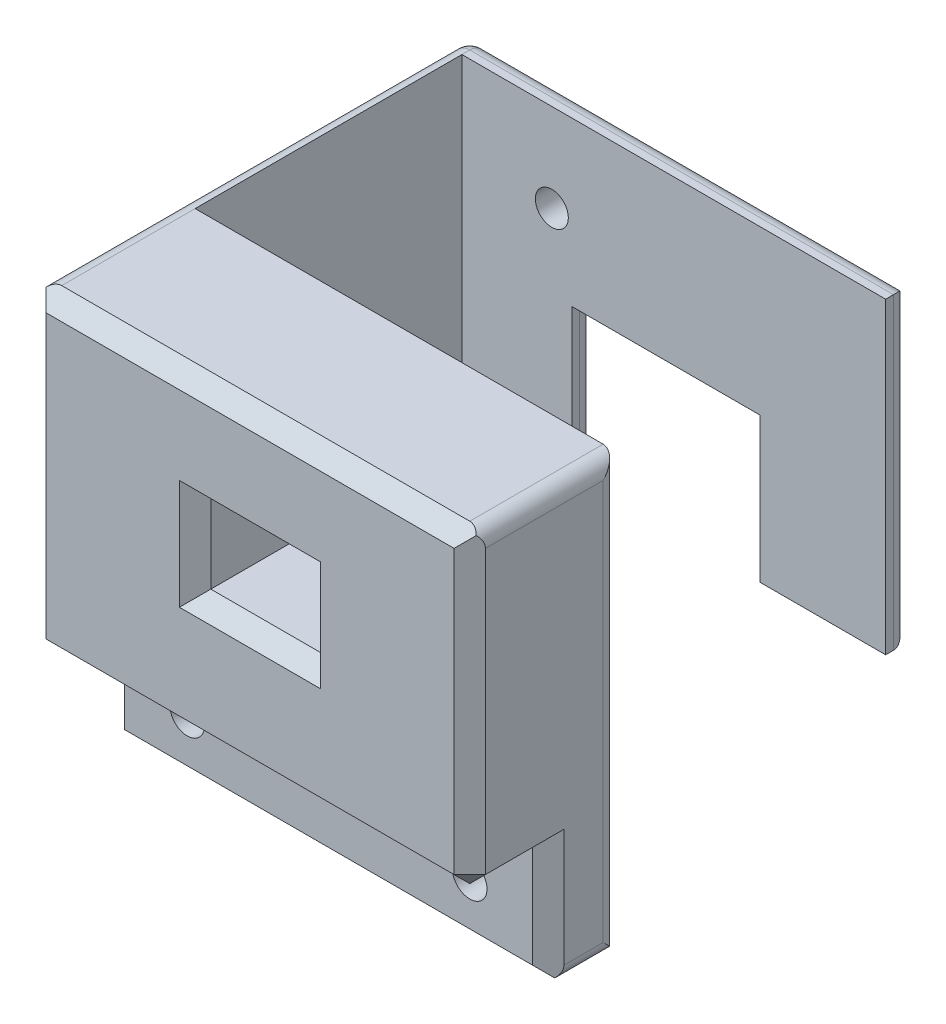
ISO-10303-21;
HEADER;
FILE_DESCRIPTION(('STEP AP214'),'2;1');
FILE_NAME('part.step','',(''),(''),'','','');
FILE_SCHEMA(('AUTOMOTIVE_DESIGN { 1 0 10303 214 1 1 1 1 }'));
ENDSEC;
DATA;
#1=APPLICATION_CONTEXT('core data for automotive mechanical design processes');
#2=APPLICATION_PROTOCOL_DEFINITION('international standard','automotive_design',2000,#1);
#3=PRODUCT_CONTEXT('',#1,'mechanical');
#4=PRODUCT('Part','Part','',(#3));
#5=PRODUCT_RELATED_PRODUCT_CATEGORY('part','',(#4));
#6=PRODUCT_DEFINITION_FORMATION('','',#4);
#7=PRODUCT_DEFINITION_CONTEXT('part definition',#1,'design');
#8=PRODUCT_DEFINITION('design','',#6,#7);
#9=PRODUCT_DEFINITION_SHAPE('','',#8);
#10=(LENGTH_UNIT() NAMED_UNIT(*) SI_UNIT(.MILLI.,.METRE.));
#11=(NAMED_UNIT(*) PLANE_ANGLE_UNIT() SI_UNIT($,.RADIAN.));
#12=(NAMED_UNIT(*) SI_UNIT($,.STERADIAN.) SOLID_ANGLE_UNIT());
#13=UNCERTAINTY_MEASURE_WITH_UNIT(LENGTH_MEASURE(1.E-05),#10,'distance_accuracy_value','');
#14=(GEOMETRIC_REPRESENTATION_CONTEXT(3) GLOBAL_UNCERTAINTY_ASSIGNED_CONTEXT((#13)) GLOBAL_UNIT_ASSIGNED_CONTEXT((#10,
#11,#12)) REPRESENTATION_CONTEXT('',''));
#15=CARTESIAN_POINT('',(0.,0.,0.));
#16=DIRECTION('',(0.,0.,1.));
#17=DIRECTION('',(1.,0.,0.));
#18=AXIS2_PLACEMENT_3D('',#15,#16,#17);
#19=CARTESIAN_POINT('',(0.,0.,-1.));
#20=DIRECTION('',(0.,0.,-1.));
#21=DIRECTION('',(0.,-1.,0.));
#22=AXIS2_PLACEMENT_3D('',#19,#20,#21);
#23=PLANE('',#22);
#24=DIRECTION('',(0.,1.,0.));
#25=VECTOR('',#24,1.);
#26=CARTESIAN_POINT('',(3.5,15.5,-1.));
#27=LINE('',#26,#25);
#28=CARTESIAN_POINT('',(3.5,15.5,-1.));
#29=VERTEX_POINT('',#28);
#30=CARTESIAN_POINT('',(3.5,20.5,-1.));
#31=VERTEX_POINT('',#30);
#32=EDGE_CURVE('E9',#29,#31,#27,.T.);
#33=ORIENTED_EDGE('',*,*,#32,.T.);
#34=DIRECTION('',(-1.,0.,0.));
#35=VECTOR('',#34,1.);
#36=CARTESIAN_POINT('',(-3.5,20.5,-1.));
#37=LINE('',#36,#35);
#38=CARTESIAN_POINT('',(-3.5,20.5,-1.));
#39=VERTEX_POINT('',#38);
#40=EDGE_CURVE('E23',#31,#39,#37,.T.);
#41=ORIENTED_EDGE('',*,*,#40,.T.);
#42=DIRECTION('',(0.,-1.,0.));
#43=VECTOR('',#42,1.);
#44=CARTESIAN_POINT('',(-3.5,15.5,-1.));
#45=LINE('',#44,#43);
#46=CARTESIAN_POINT('',(-3.5,15.5,-1.));
#47=VERTEX_POINT('',#46);
#48=EDGE_CURVE('E478',#39,#47,#45,.T.);
#49=ORIENTED_EDGE('',*,*,#48,.T.);
#50=DIRECTION('',(1.,0.,0.));
#51=VECTOR('',#50,1.);
#52=CARTESIAN_POINT('',(-3.5,15.5,-1.));
#53=LINE('',#52,#51);
#54=EDGE_CURVE('E472',#47,#29,#53,.T.);
#55=ORIENTED_EDGE('',*,*,#54,.T.);
#56=EDGE_LOOP('',(#33,#41,#49,#55));
#57=FACE_BOUND('',#56,.T.);
#58=ADVANCED_FACE('F15',(#57),#23,.F.);
#59=CARTESIAN_POINT('',(3.5,15.5,-1.));
#60=DIRECTION('',(1.,0.,0.));
#61=DIRECTION('',(0.,1.,0.));
#62=AXIS2_PLACEMENT_3D('',#59,#60,#61);
#63=PLANE('',#62);
#64=DIRECTION('',(0.,0.,1.));
#65=VECTOR('',#64,1.);
#66=CARTESIAN_POINT('',(3.5,15.5,-1.));
#67=LINE('',#66,#65);
#68=CARTESIAN_POINT('',(3.5,15.5,4.));
#69=VERTEX_POINT('',#68);
#70=EDGE_CURVE('E469',#29,#69,#67,.T.);
#71=ORIENTED_EDGE('',*,*,#70,.T.);
#72=DIRECTION('',(0.,1.,0.));
#73=VECTOR('',#72,1.);
#74=CARTESIAN_POINT('',(3.5,15.5,4.));
#75=LINE('',#74,#73);
#76=CARTESIAN_POINT('',(3.5,20.5,4.));
#77=VERTEX_POINT('',#76);
#78=EDGE_CURVE('E795',#69,#77,#75,.T.);
#79=ORIENTED_EDGE('',*,*,#78,.T.);
#80=DIRECTION('',(0.,0.,1.));
#81=VECTOR('',#80,1.);
#82=CARTESIAN_POINT('',(3.5,20.5,-1.));
#83=LINE('',#82,#81);
#84=EDGE_CURVE('E480',#31,#77,#83,.T.);
#85=ORIENTED_EDGE('',*,*,#84,.F.);
#86=ORIENTED_EDGE('',*,*,#32,.F.);
#87=EDGE_LOOP('',(#71,#79,#85,#86));
#88=FACE_BOUND('',#87,.T.);
#89=ADVANCED_FACE('F1255',(#88),#63,.F.);
#90=CARTESIAN_POINT('',(-3.5,20.5,-1.));
#91=DIRECTION('',(0.,1.,0.));
#92=DIRECTION('',(1.,0.,0.));
#93=AXIS2_PLACEMENT_3D('',#90,#91,#92);
#94=PLANE('',#93);
#95=ORIENTED_EDGE('',*,*,#84,.T.);
#96=DIRECTION('',(-1.,0.,0.));
#97=VECTOR('',#96,1.);
#98=CARTESIAN_POINT('',(-3.5,20.5,4.));
#99=LINE('',#98,#97);
#100=CARTESIAN_POINT('',(-3.5,20.5,4.));
#101=VERTEX_POINT('',#100);
#102=EDGE_CURVE('E792',#77,#101,#99,.T.);
#103=ORIENTED_EDGE('',*,*,#102,.T.);
#104=DIRECTION('',(0.,0.,1.));
#105=VECTOR('',#104,1.);
#106=CARTESIAN_POINT('',(-3.5,20.5,-1.));
#107=LINE('',#106,#105);
#108=EDGE_CURVE('E475',#39,#101,#107,.T.);
#109=ORIENTED_EDGE('',*,*,#108,.F.);
#110=ORIENTED_EDGE('',*,*,#40,.F.);
#111=EDGE_LOOP('',(#95,#103,#109,#110));
#112=FACE_BOUND('',#111,.T.);
#113=ADVANCED_FACE('F1259',(#112),#94,.F.);
#114=CARTESIAN_POINT('',(-3.5,15.5,-1.));
#115=DIRECTION('',(-1.,0.,0.));
#116=DIRECTION('',(0.,0.,1.));
#117=AXIS2_PLACEMENT_3D('',#114,#115,#116);
#118=PLANE('',#117);
#119=ORIENTED_EDGE('',*,*,#108,.T.);
#120=DIRECTION('',(0.,-1.,0.));
#121=VECTOR('',#120,1.);
#122=CARTESIAN_POINT('',(-3.5,15.5,4.));
#123=LINE('',#122,#121);
#124=CARTESIAN_POINT('',(-3.5,15.5,4.));
#125=VERTEX_POINT('',#124);
#126=EDGE_CURVE('E785',#101,#125,#123,.T.);
#127=ORIENTED_EDGE('',*,*,#126,.T.);
#128=DIRECTION('',(0.,0.,1.));
#129=VECTOR('',#128,1.);
#130=CARTESIAN_POINT('',(-3.5,15.5,-1.));
#131=LINE('',#130,#129);
#132=EDGE_CURVE('E435',#47,#125,#131,.T.);
#133=ORIENTED_EDGE('',*,*,#132,.F.);
#134=ORIENTED_EDGE('',*,*,#48,.F.);
#135=EDGE_LOOP('',(#119,#127,#133,#134));
#136=FACE_BOUND('',#135,.T.);
#137=ADVANCED_FACE('F1264',(#136),#118,.F.);
#138=CARTESIAN_POINT('',(-3.5,15.5,-1.));
#139=DIRECTION('',(0.,-1.,0.));
#140=DIRECTION('',(0.,0.,-1.));
#141=AXIS2_PLACEMENT_3D('',#138,#139,#140);
#142=PLANE('',#141);
#143=ORIENTED_EDGE('',*,*,#132,.T.);
#144=DIRECTION('',(1.,0.,0.));
#145=VECTOR('',#144,1.);
#146=CARTESIAN_POINT('',(-3.5,15.5,4.));
#147=LINE('',#146,#145);
#148=EDGE_CURVE('E677',#125,#69,#147,.T.);
#149=ORIENTED_EDGE('',*,*,#148,.T.);
#150=ORIENTED_EDGE('',*,*,#70,.F.);
#151=ORIENTED_EDGE('',*,*,#54,.F.);
#152=EDGE_LOOP('',(#143,#149,#150,#151));
#153=FACE_BOUND('',#152,.T.);
#154=ADVANCED_FACE('F1328',(#153),#142,.F.);
#155=CARTESIAN_POINT('',(0.,0.,-23.));
#156=DIRECTION('',(0.,0.,-1.));
#157=DIRECTION('',(0.,-1.,0.));
#158=AXIS2_PLACEMENT_3D('',#155,#156,#157);
#159=PLANE('',#158);
#160=CARTESIAN_POINT('',(-7.270627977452,21.878201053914,-23.));
#161=DIRECTION('',(0.,0.,-1.));
#162=DIRECTION('',(-1.,0.,0.));
#163=AXIS2_PLACEMENT_3D('',#160,#161,#162);
#164=CIRCLE('',#163,1.05);
#165=CARTESIAN_POINT('',(-8.320627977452,21.878201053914,-23.));
#166=VERTEX_POINT('',#165);
#167=EDGE_CURVE('E629',#166,#166,#164,.T.);
#168=ORIENTED_EDGE('',*,*,#167,.F.);
#169=EDGE_LOOP('',(#168));
#170=FACE_BOUND('',#169,.T.);
#171=DIRECTION('',(-1.,0.,0.));
#172=VECTOR('',#171,1.);
#173=CARTESIAN_POINT('',(-6.,18.101462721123,-23.));
#174=LINE('',#173,#172);
#175=CARTESIAN_POINT('',(7.,18.101462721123,-23.));
#176=VERTEX_POINT('',#175);
#177=CARTESIAN_POINT('',(-7.,18.101462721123,-23.));
#178=VERTEX_POINT('',#177);
#179=EDGE_CURVE('E452',#176,#178,#174,.T.);
#180=ORIENTED_EDGE('',*,*,#179,.T.);
#181=DIRECTION('',(0.,-1.,0.));
#182=VECTOR('',#181,1.);
#183=CARTESIAN_POINT('',(-7.,7.875526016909,-23.));
#184=LINE('',#183,#182);
#185=CARTESIAN_POINT('',(-7.,8.875526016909,-23.));
#186=VERTEX_POINT('',#185);
#187=EDGE_CURVE('E436',#178,#186,#184,.T.);
#188=ORIENTED_EDGE('',*,*,#187,.T.);
#189=DIRECTION('',(-1.,0.,0.));
#190=VECTOR('',#189,1.);
#191=CARTESIAN_POINT('',(-14.,8.875526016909,-23.));
#192=LINE('',#191,#190);
#193=CARTESIAN_POINT('',(-13.,8.875526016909,-23.));
#194=VERTEX_POINT('',#193);
#195=EDGE_CURVE('E806',#186,#194,#192,.T.);
#196=ORIENTED_EDGE('',*,*,#195,.T.);
#197=DIRECTION('',(0.,1.,0.));
#198=VECTOR('',#197,1.);
#199=CARTESIAN_POINT('',(-13.,27.5,-23.));
#200=LINE('',#199,#198);
#201=CARTESIAN_POINT('',(-13.,26.5,-23.));
#202=VERTEX_POINT('',#201);
#203=EDGE_CURVE('E753',#194,#202,#200,.T.);
#204=ORIENTED_EDGE('',*,*,#203,.T.);
#205=DIRECTION('',(1.,0.,0.));
#206=VECTOR('',#205,1.);
#207=CARTESIAN_POINT('',(14.,26.5,-23.));
#208=LINE('',#207,#206);
#209=CARTESIAN_POINT('',(13.,26.5,-23.));
#210=VERTEX_POINT('',#209);
#211=EDGE_CURVE('E431',#202,#210,#208,.T.);
#212=ORIENTED_EDGE('',*,*,#211,.T.);
#213=DIRECTION('',(0.,-1.,0.));
#214=VECTOR('',#213,1.);
#215=CARTESIAN_POINT('',(13.,7.875526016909,-23.));
#216=LINE('',#215,#214);
#217=CARTESIAN_POINT('',(13.,8.875526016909,-23.));
#218=VERTEX_POINT('',#217);
#219=EDGE_CURVE('E422',#210,#218,#216,.T.);
#220=ORIENTED_EDGE('',*,*,#219,.T.);
#221=DIRECTION('',(-1.,0.,0.));
#222=VECTOR('',#221,1.);
#223=CARTESIAN_POINT('',(6.,8.875526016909,-23.));
#224=LINE('',#223,#222);
#225=CARTESIAN_POINT('',(7.,8.875526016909,-23.));
#226=VERTEX_POINT('',#225);
#227=EDGE_CURVE('E428',#218,#226,#224,.T.);
#228=ORIENTED_EDGE('',*,*,#227,.T.);
#229=DIRECTION('',(0.,1.,0.));
#230=VECTOR('',#229,1.);
#231=CARTESIAN_POINT('',(7.,17.101462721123,-23.));
#232=LINE('',#231,#230);
#233=EDGE_CURVE('E826',#226,#176,#232,.T.);
#234=ORIENTED_EDGE('',*,*,#233,.T.);
#235=EDGE_LOOP('',(#180,#188,#196,#204,#212,#220,#228,#234));
#236=FACE_BOUND('',#235,.T.);
#237=ADVANCED_FACE('F425',(#170,#236),#159,.T.);
#238=CARTESIAN_POINT('',(13.,0.,-22.));
#239=DIRECTION('',(0.,1.,0.));
#240=DIRECTION('',(0.,0.,1.));
#241=AXIS2_PLACEMENT_3D('',#238,#239,#240);
#242=CYLINDRICAL_SURFACE('',#241,1.);
#243=CARTESIAN_POINT('',(13.,26.5,-23.));
#244=CARTESIAN_POINT('',(13.585786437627,27.085786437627,-23.));
#245=CARTESIAN_POINT('',(14.,27.5,-22.58578643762));
#246=CARTESIAN_POINT('',(14.,27.5,-22.));
#247=(BOUNDED_CURVE() B_SPLINE_CURVE(3,(#243,#244,#245,#246),.UNSPECIFIED.,.F.,
.F.) B_SPLINE_CURVE_WITH_KNOTS((4,4),(1.570796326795,3.14159265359),
.UNSPECIFIED.) CURVE() GEOMETRIC_REPRESENTATION_ITEM() RATIONAL_B_SPLINE_CURVE((1.,
0.804737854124,0.804737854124,1.)) REPRESENTATION_ITEM(''));
#248=CARTESIAN_POINT('',(14.,27.5,-22.));
#249=VERTEX_POINT('',#248);
#250=EDGE_CURVE('E743',#210,#249,#247,.T.);
#251=ORIENTED_EDGE('',*,*,#250,.T.);
#252=DIRECTION('',(0.,1.,0.));
#253=VECTOR('',#252,1.);
#254=CARTESIAN_POINT('',(14.,27.5,-22.));
#255=LINE('',#254,#253);
#256=CARTESIAN_POINT('',(14.,7.875526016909,-22.));
#257=VERTEX_POINT('',#256);
#258=EDGE_CURVE('E442',#257,#249,#255,.T.);
#259=ORIENTED_EDGE('',*,*,#258,.F.);
#260=CARTESIAN_POINT('',(14.,7.875526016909,-22.));
#261=CARTESIAN_POINT('',(14.,7.875526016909,-22.58578643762));
#262=CARTESIAN_POINT('',(13.585786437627,8.289739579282,-23.));
#263=CARTESIAN_POINT('',(13.,8.875526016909,-23.));
#264=(BOUNDED_CURVE() B_SPLINE_CURVE(3,(#260,#261,#262,#263),.UNSPECIFIED.,.F.,
.F.) B_SPLINE_CURVE_WITH_KNOTS((4,4),(3.14159265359,4.712388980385),
.UNSPECIFIED.) CURVE() GEOMETRIC_REPRESENTATION_ITEM() RATIONAL_B_SPLINE_CURVE((1.,
0.804737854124,0.804737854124,1.)) REPRESENTATION_ITEM(''));
#265=EDGE_CURVE('E439',#257,#218,#264,.T.);
#266=ORIENTED_EDGE('',*,*,#265,.T.);
#267=ORIENTED_EDGE('',*,*,#219,.F.);
#268=EDGE_LOOP('',(#251,#259,#266,#267));
#269=FACE_BOUND('',#268,.T.);
#270=ADVANCED_FACE('F440',(#269),#242,.T.);
#271=CARTESIAN_POINT('',(-7.,7.875526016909,-22.));
#272=DIRECTION('',(0.,-1.,0.));
#273=DIRECTION('',(0.,0.,-1.));
#274=AXIS2_PLACEMENT_3D('',#271,#272,#273);
#275=CYLINDRICAL_SURFACE('',#274,1.);
#276=CARTESIAN_POINT('',(-6.,7.875526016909,-22.));
#277=CARTESIAN_POINT('',(-6.,7.875526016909,-22.58578643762));
#278=CARTESIAN_POINT('',(-6.41421356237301,8.289739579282,-23.));
#279=CARTESIAN_POINT('',(-7.,8.875526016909,-23.));
#280=(BOUNDED_CURVE() B_SPLINE_CURVE(3,(#276,#277,#278,#279),.UNSPECIFIED.,.F.,
.F.) B_SPLINE_CURVE_WITH_KNOTS((4,4),(0.,1.570796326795),
.UNSPECIFIED.) CURVE() GEOMETRIC_REPRESENTATION_ITEM() RATIONAL_B_SPLINE_CURVE((1.,
0.804737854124,0.804737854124,1.)) REPRESENTATION_ITEM(''));
#281=CARTESIAN_POINT('',(-6.,7.875526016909,-22.));
#282=VERTEX_POINT('',#281);
#283=EDGE_CURVE('E810',#282,#186,#280,.T.);
#284=ORIENTED_EDGE('',*,*,#283,.T.);
#285=ORIENTED_EDGE('',*,*,#187,.F.);
#286=CARTESIAN_POINT('',(-6.,17.101462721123,-22.));
#287=CARTESIAN_POINT('',(-6.,17.101462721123,-22.58578643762));
#288=CARTESIAN_POINT('',(-6.41421356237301,17.515676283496,-23.));
#289=CARTESIAN_POINT('',(-7.,18.101462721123,-23.));
#290=(BOUNDED_CURVE() B_SPLINE_CURVE(3,(#286,#287,#288,#289),.UNSPECIFIED.,.F.,
.F.) B_SPLINE_CURVE_WITH_KNOTS((4,4),(0.,1.570796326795),
.UNSPECIFIED.) CURVE() GEOMETRIC_REPRESENTATION_ITEM() RATIONAL_B_SPLINE_CURVE((1.,
0.804737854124,0.804737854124,1.)) REPRESENTATION_ITEM(''));
#291=CARTESIAN_POINT('',(-6.,17.101462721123,-22.));
#292=VERTEX_POINT('',#291);
#293=EDGE_CURVE('E456',#292,#178,#290,.T.);
#294=ORIENTED_EDGE('',*,*,#293,.F.);
#295=DIRECTION('',(0.,1.,0.));
#296=VECTOR('',#295,1.);
#297=CARTESIAN_POINT('',(-6.,17.101462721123,-22.));
#298=LINE('',#297,#296);
#299=EDGE_CURVE('E709',#282,#292,#298,.T.);
#300=ORIENTED_EDGE('',*,*,#299,.F.);
#301=EDGE_LOOP('',(#284,#285,#294,#300));
#302=FACE_BOUND('',#301,.T.);
#303=ADVANCED_FACE('F852',(#302),#275,.T.);
#304=CARTESIAN_POINT('',(14.,8.875526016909,-22.));
#305=DIRECTION('',(-1.,0.,0.));
#306=DIRECTION('',(0.,0.,1.));
#307=AXIS2_PLACEMENT_3D('',#304,#305,#306);
#308=CYLINDRICAL_SURFACE('',#307,1.);
#309=CARTESIAN_POINT('',(6.,7.875526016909,-22.));
#310=CARTESIAN_POINT('',(6.,7.875526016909,-22.58578643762));
#311=CARTESIAN_POINT('',(6.41421356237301,8.289739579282,-23.));
#312=CARTESIAN_POINT('',(7.,8.875526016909,-23.));
#313=(BOUNDED_CURVE() B_SPLINE_CURVE(3,(#309,#310,#311,#312),.UNSPECIFIED.,.F.,
.F.) B_SPLINE_CURVE_WITH_KNOTS((4,4),(0.,1.570796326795),
.UNSPECIFIED.) CURVE() GEOMETRIC_REPRESENTATION_ITEM() RATIONAL_B_SPLINE_CURVE((1.,
0.804737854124,0.804737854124,1.)) REPRESENTATION_ITEM(''));
#314=CARTESIAN_POINT('',(6.,7.875526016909,-22.));
#315=VERTEX_POINT('',#314);
#316=EDGE_CURVE('E449',#315,#226,#313,.T.);
#317=ORIENTED_EDGE('',*,*,#316,.T.);
#318=ORIENTED_EDGE('',*,*,#227,.F.);
#319=ORIENTED_EDGE('',*,*,#265,.F.);
#320=DIRECTION('',(1.,0.,0.));
#321=VECTOR('',#320,1.);
#322=CARTESIAN_POINT('',(14.,7.875526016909,-22.));
#323=LINE('',#322,#321);
#324=EDGE_CURVE('E710',#315,#257,#323,.T.);
#325=ORIENTED_EDGE('',*,*,#324,.F.);
#326=EDGE_LOOP('',(#317,#318,#319,#325));
#327=FACE_BOUND('',#326,.T.);
#328=ADVANCED_FACE('F448',(#327),#308,.T.);
#329=CARTESIAN_POINT('',(-6.,18.101462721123,-22.));
#330=DIRECTION('',(-1.,0.,0.));
#331=DIRECTION('',(0.,0.,1.));
#332=AXIS2_PLACEMENT_3D('',#329,#330,#331);
#333=CYLINDRICAL_SURFACE('',#332,1.);
#334=ORIENTED_EDGE('',*,*,#293,.T.);
#335=ORIENTED_EDGE('',*,*,#179,.F.);
#336=CARTESIAN_POINT('',(6.,17.101462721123,-22.));
#337=CARTESIAN_POINT('',(6.,17.101462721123,-22.58578643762));
#338=CARTESIAN_POINT('',(6.41421356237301,17.515676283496,-23.));
#339=CARTESIAN_POINT('',(7.,18.101462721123,-23.));
#340=(BOUNDED_CURVE() B_SPLINE_CURVE(3,(#336,#337,#338,#339),.UNSPECIFIED.,.F.,
.F.) B_SPLINE_CURVE_WITH_KNOTS((4,4),(0.,1.570796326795),
.UNSPECIFIED.) CURVE() GEOMETRIC_REPRESENTATION_ITEM() RATIONAL_B_SPLINE_CURVE((1.,
0.804737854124,0.804737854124,1.)) REPRESENTATION_ITEM(''));
#341=CARTESIAN_POINT('',(6.,17.101462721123,-22.));
#342=VERTEX_POINT('',#341);
#343=EDGE_CURVE('E809',#342,#176,#340,.T.);
#344=ORIENTED_EDGE('',*,*,#343,.F.);
#345=DIRECTION('',(1.,0.,0.));
#346=VECTOR('',#345,1.);
#347=CARTESIAN_POINT('',(6.,17.101462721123,-22.));
#348=LINE('',#347,#346);
#349=EDGE_CURVE('E725',#292,#342,#348,.T.);
#350=ORIENTED_EDGE('',*,*,#349,.F.);
#351=EDGE_LOOP('',(#334,#335,#344,#350));
#352=FACE_BOUND('',#351,.T.);
#353=ADVANCED_FACE('F848',(#352),#333,.T.);
#354=CARTESIAN_POINT('',(7.,7.875526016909,-22.));
#355=DIRECTION('',(0.,1.,0.));
#356=DIRECTION('',(0.,0.,1.));
#357=AXIS2_PLACEMENT_3D('',#354,#355,#356);
#358=CYLINDRICAL_SURFACE('',#357,1.);
#359=ORIENTED_EDGE('',*,*,#343,.T.);
#360=ORIENTED_EDGE('',*,*,#233,.F.);
#361=ORIENTED_EDGE('',*,*,#316,.F.);
#362=DIRECTION('',(0.,-1.,0.));
#363=VECTOR('',#362,1.);
#364=CARTESIAN_POINT('',(6.,7.875526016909,-22.));
#365=LINE('',#364,#363);
#366=EDGE_CURVE('E573',#342,#315,#365,.T.);
#367=ORIENTED_EDGE('',*,*,#366,.F.);
#368=EDGE_LOOP('',(#359,#360,#361,#367));
#369=FACE_BOUND('',#368,.T.);
#370=ADVANCED_FACE('F1271',(#369),#358,.T.);
#371=CARTESIAN_POINT('',(-6.,8.875526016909,-22.));
#372=DIRECTION('',(-1.,0.,0.));
#373=DIRECTION('',(0.,0.,1.));
#374=AXIS2_PLACEMENT_3D('',#371,#372,#373);
#375=CYLINDRICAL_SURFACE('',#374,1.);
#376=ORIENTED_EDGE('',*,*,#283,.F.);
#377=DIRECTION('',(1.,0.,0.));
#378=VECTOR('',#377,1.);
#379=CARTESIAN_POINT('',(-6.,7.875526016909,-22.));
#380=LINE('',#379,#378);
#381=CARTESIAN_POINT('',(-13.,7.875526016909,-22.));
#382=VERTEX_POINT('',#381);
#383=EDGE_CURVE('E577',#382,#282,#380,.T.);
#384=ORIENTED_EDGE('',*,*,#383,.F.);
#385=CARTESIAN_POINT('',(-13.,8.875526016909,-22.));
#386=DIRECTION('',(-1.,0.,0.));
#387=DIRECTION('',(0.,0.,1.));
#388=AXIS2_PLACEMENT_3D('',#385,#386,#387);
#389=CIRCLE('',#388,1.);
#390=EDGE_CURVE('E578',#194,#382,#389,.T.);
#391=ORIENTED_EDGE('',*,*,#390,.F.);
#392=ORIENTED_EDGE('',*,*,#195,.F.);
#393=EDGE_LOOP('',(#376,#384,#391,#392));
#394=FACE_BOUND('',#393,.T.);
#395=ADVANCED_FACE('F866',(#394),#375,.T.);
#396=CARTESIAN_POINT('',(-13.,7.5,0.));
#397=DIRECTION('',(-0.707106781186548,-0.707106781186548,0.));
#398=DIRECTION('',(-0.707106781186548,0.707106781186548,0.));
#399=AXIS2_PLACEMENT_3D('',#396,#397,#398);
#400=PLANE('',#399);
#401=DIRECTION('',(0.707106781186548,-0.707106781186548,0.));
#402=VECTOR('',#401,1.);
#403=CARTESIAN_POINT('',(-13.,7.5,4.));
#404=LINE('',#403,#402);
#405=CARTESIAN_POINT('',(-13.70710678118,8.207106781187,4.));
#406=VERTEX_POINT('',#405);
#407=CARTESIAN_POINT('',(-13.,7.5,4.));
#408=VERTEX_POINT('',#407);
#409=EDGE_CURVE('E765',#406,#408,#404,.T.);
#410=ORIENTED_EDGE('',*,*,#409,.F.);
#411=DIRECTION('',(0.,0.,-1.));
#412=VECTOR('',#411,1.);
#413=CARTESIAN_POINT('',(-13.70710678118,8.207106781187,-1.));
#414=LINE('',#413,#412);
#415=CARTESIAN_POINT('',(-13.70710678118,8.207106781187,-0.707106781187));
#416=VERTEX_POINT('',#415);
#417=EDGE_CURVE('E756',#406,#416,#414,.T.);
#418=ORIENTED_EDGE('',*,*,#417,.T.);
#419=DIRECTION('',(0.577350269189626,-0.577350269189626,0.577350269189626));
#420=VECTOR('',#419,1.);
#421=CARTESIAN_POINT('',(-13.,7.5,0.));
#422=LINE('',#421,#420);
#423=CARTESIAN_POINT('',(-13.,7.5,0.));
#424=VERTEX_POINT('',#423);
#425=EDGE_CURVE('E618',#416,#424,#422,.T.);
#426=ORIENTED_EDGE('',*,*,#425,.T.);
#427=DIRECTION('',(0.,0.,-1.));
#428=VECTOR('',#427,1.);
#429=CARTESIAN_POINT('',(-13.,7.5,0.));
#430=LINE('',#429,#428);
#431=EDGE_CURVE('E805',#408,#424,#430,.T.);
#432=ORIENTED_EDGE('',*,*,#431,.F.);
#433=EDGE_LOOP('',(#410,#418,#426,#432));
#434=FACE_BOUND('',#433,.T.);
#435=ADVANCED_FACE('F1277',(#434),#400,.T.);
#436=CARTESIAN_POINT('',(0.,7.5,0.));
#437=DIRECTION('',(0.,-1.,0.));
#438=DIRECTION('',(0.,0.,-1.));
#439=AXIS2_PLACEMENT_3D('',#436,#437,#438);
#440=PLANE('',#439);
#441=DIRECTION('',(-1.,0.,0.));
#442=VECTOR('',#441,1.);
#443=CARTESIAN_POINT('',(-14.,7.5,4.));
#444=LINE('',#443,#442);
#445=CARTESIAN_POINT('',(13.,7.5,4.));
#446=VERTEX_POINT('',#445);
#447=EDGE_CURVE('E801',#446,#408,#444,.T.);
#448=ORIENTED_EDGE('',*,*,#447,.T.);
#449=ORIENTED_EDGE('',*,*,#431,.T.);
#450=DIRECTION('',(1.,0.,0.));
#451=VECTOR('',#450,1.);
#452=CARTESIAN_POINT('',(-14.,7.5,0.));
#453=LINE('',#452,#451);
#454=CARTESIAN_POINT('',(13.,7.5,0.));
#455=VERTEX_POINT('',#454);
#456=EDGE_CURVE('E694',#424,#455,#453,.T.);
#457=ORIENTED_EDGE('',*,*,#456,.T.);
#458=DIRECTION('',(0.,0.,1.));
#459=VECTOR('',#458,1.);
#460=CARTESIAN_POINT('',(13.,7.5,5.));
#461=LINE('',#460,#459);
#462=EDGE_CURVE('E623',#455,#446,#461,.T.);
#463=ORIENTED_EDGE('',*,*,#462,.T.);
#464=EDGE_LOOP('',(#448,#449,#457,#463));
#465=FACE_BOUND('',#464,.T.);
#466=ADVANCED_FACE('F1282',(#465),#440,.T.);
#467=CARTESIAN_POINT('',(13.,8.5,5.));
#468=DIRECTION('',(0.577350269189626,-0.577350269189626,0.577350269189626));
#469=DIRECTION('',(0.,-0.707106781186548,-0.707106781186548));
#470=AXIS2_PLACEMENT_3D('',#467,#468,#469);
#471=PLANE('',#470);
#472=DIRECTION('',(0.707106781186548,0.707106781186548,0.));
#473=VECTOR('',#472,1.);
#474=CARTESIAN_POINT('',(13.5,8.,4.));
#475=LINE('',#474,#473);
#476=CARTESIAN_POINT('',(14.,8.5,4.));
#477=VERTEX_POINT('',#476);
#478=EDGE_CURVE('E685',#446,#477,#475,.T.);
#479=ORIENTED_EDGE('',*,*,#478,.T.);
#480=DIRECTION('',(-0.707106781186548,0.,0.707106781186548));
#481=VECTOR('',#480,1.);
#482=CARTESIAN_POINT('',(13.,8.5,5.));
#483=LINE('',#482,#481);
#484=CARTESIAN_POINT('',(13.,8.5,5.));
#485=VERTEX_POINT('',#484);
#486=EDGE_CURVE('E611',#477,#485,#483,.T.);
#487=ORIENTED_EDGE('',*,*,#486,.T.);
#488=DIRECTION('',(0.,0.707106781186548,0.707106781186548));
#489=VECTOR('',#488,1.);
#490=CARTESIAN_POINT('',(13.,8.5,5.));
#491=LINE('',#490,#489);
#492=EDGE_CURVE('E798',#446,#485,#491,.T.);
#493=ORIENTED_EDGE('',*,*,#492,.F.);
#494=EDGE_LOOP('',(#479,#487,#493));
#495=FACE_BOUND('',#494,.T.);
#496=ADVANCED_FACE('F1278',(#495),#471,.T.);
#497=CARTESIAN_POINT('',(0.,7.5,4.));
#498=DIRECTION('',(0.,-0.707106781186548,0.707106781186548));
#499=DIRECTION('',(-1.,0.,0.));
#500=AXIS2_PLACEMENT_3D('',#497,#498,#499);
#501=PLANE('',#500);
#502=ORIENTED_EDGE('',*,*,#492,.T.);
#503=DIRECTION('',(1.,0.,0.));
#504=VECTOR('',#503,1.);
#505=CARTESIAN_POINT('',(14.,8.5,5.));
#506=LINE('',#505,#504);
#507=CARTESIAN_POINT('',(-13.,8.5,5.));
#508=VERTEX_POINT('',#507);
#509=EDGE_CURVE('E593',#508,#485,#506,.T.);
#510=ORIENTED_EDGE('',*,*,#509,.F.);
#511=DIRECTION('',(0.,-0.707106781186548,-0.707106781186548));
#512=VECTOR('',#511,1.);
#513=CARTESIAN_POINT('',(-13.,7.5,4.));
#514=LINE('',#513,#512);
#515=EDGE_CURVE('E678',#508,#408,#514,.T.);
#516=ORIENTED_EDGE('',*,*,#515,.T.);
#517=ORIENTED_EDGE('',*,*,#447,.F.);
#518=EDGE_LOOP('',(#502,#510,#516,#517));
#519=FACE_BOUND('',#518,.T.);
#520=ADVANCED_FACE('F1281',(#519),#501,.T.);
#521=CARTESIAN_POINT('',(3.5,15.5,4.));
#522=DIRECTION('',(0.707106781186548,0.,-0.707106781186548));
#523=DIRECTION('',(0.,-1.,0.));
#524=AXIS2_PLACEMENT_3D('',#521,#522,#523);
#525=PLANE('',#524);
#526=DIRECTION('',(-0.577350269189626,0.577350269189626,-0.577350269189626));
#527=VECTOR('',#526,1.);
#528=CARTESIAN_POINT('',(3.5,15.5,4.));
#529=LINE('',#528,#527);
#530=CARTESIAN_POINT('',(4.5,14.5,5.));
#531=VERTEX_POINT('',#530);
#532=EDGE_CURVE('E673',#531,#69,#529,.T.);
#533=ORIENTED_EDGE('',*,*,#532,.F.);
#534=DIRECTION('',(0.,-1.,0.));
#535=VECTOR('',#534,1.);
#536=CARTESIAN_POINT('',(4.5,27.5,5.));
#537=LINE('',#536,#535);
#538=CARTESIAN_POINT('',(4.5,21.5,5.));
#539=VERTEX_POINT('',#538);
#540=EDGE_CURVE('E598',#539,#531,#537,.T.);
#541=ORIENTED_EDGE('',*,*,#540,.F.);
#542=DIRECTION('',(0.577350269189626,0.577350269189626,0.577350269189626));
#543=VECTOR('',#542,1.);
#544=CARTESIAN_POINT('',(1.166666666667,18.166666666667,1.666666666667));
#545=LINE('',#544,#543);
#546=EDGE_CURVE('E789',#77,#539,#545,.T.);
#547=ORIENTED_EDGE('',*,*,#546,.F.);
#548=ORIENTED_EDGE('',*,*,#78,.F.);
#549=EDGE_LOOP('',(#533,#541,#547,#548));
#550=FACE_BOUND('',#549,.T.);
#551=ADVANCED_FACE('F1286',(#550),#525,.F.);
#552=CARTESIAN_POINT('',(-3.5,20.5,4.));
#553=DIRECTION('',(0.,0.707106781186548,-0.707106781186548));
#554=DIRECTION('',(-1.,0.,0.));
#555=AXIS2_PLACEMENT_3D('',#552,#553,#554);
#556=PLANE('',#555);
#557=ORIENTED_EDGE('',*,*,#546,.T.);
#558=DIRECTION('',(1.,0.,0.));
#559=VECTOR('',#558,1.);
#560=CARTESIAN_POINT('',(-14.,21.5,5.));
#561=LINE('',#560,#559);
#562=CARTESIAN_POINT('',(-4.5,21.5,5.));
#563=VERTEX_POINT('',#562);
#564=EDGE_CURVE('E663',#563,#539,#561,.T.);
#565=ORIENTED_EDGE('',*,*,#564,.F.);
#566=DIRECTION('',(-0.577350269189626,0.577350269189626,0.577350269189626));
#567=VECTOR('',#566,1.);
#568=CARTESIAN_POINT('',(-1.833333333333,18.833333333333,2.333333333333));
#569=LINE('',#568,#567);
#570=EDGE_CURVE('E782',#101,#563,#569,.T.);
#571=ORIENTED_EDGE('',*,*,#570,.F.);
#572=ORIENTED_EDGE('',*,*,#102,.F.);
#573=EDGE_LOOP('',(#557,#565,#571,#572));
#574=FACE_BOUND('',#573,.T.);
#575=ADVANCED_FACE('F1288',(#574),#556,.F.);
#576=CARTESIAN_POINT('',(-3.5,15.5,4.));
#577=DIRECTION('',(-0.707106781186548,0.,-0.707106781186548));
#578=DIRECTION('',(-0.707106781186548,0.,0.707106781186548));
#579=AXIS2_PLACEMENT_3D('',#576,#577,#578);
#580=PLANE('',#579);
#581=ORIENTED_EDGE('',*,*,#570,.T.);
#582=DIRECTION('',(0.,1.,0.));
#583=VECTOR('',#582,1.);
#584=CARTESIAN_POINT('',(-4.5,27.5,5.));
#585=LINE('',#584,#583);
#586=CARTESIAN_POINT('',(-4.5,14.5,5.));
#587=VERTEX_POINT('',#586);
#588=EDGE_CURVE('E659',#587,#563,#585,.T.);
#589=ORIENTED_EDGE('',*,*,#588,.F.);
#590=DIRECTION('',(0.577350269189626,0.577350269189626,-0.577350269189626));
#591=VECTOR('',#590,1.);
#592=CARTESIAN_POINT('',(-3.5,15.5,4.));
#593=LINE('',#592,#591);
#594=EDGE_CURVE('E778',#587,#125,#593,.T.);
#595=ORIENTED_EDGE('',*,*,#594,.T.);
#596=ORIENTED_EDGE('',*,*,#126,.F.);
#597=EDGE_LOOP('',(#581,#589,#595,#596));
#598=FACE_BOUND('',#597,.T.);
#599=ADVANCED_FACE('F1291',(#598),#580,.F.);
#600=CARTESIAN_POINT('',(-3.5,15.5,4.));
#601=DIRECTION('',(0.,-0.707106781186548,-0.707106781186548));
#602=DIRECTION('',(0.,-0.707106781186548,0.707106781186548));
#603=AXIS2_PLACEMENT_3D('',#600,#601,#602);
#604=PLANE('',#603);
#605=ORIENTED_EDGE('',*,*,#532,.T.);
#606=ORIENTED_EDGE('',*,*,#148,.F.);
#607=ORIENTED_EDGE('',*,*,#594,.F.);
#608=DIRECTION('',(-1.,0.,0.));
#609=VECTOR('',#608,1.);
#610=CARTESIAN_POINT('',(-14.,14.5,5.));
#611=LINE('',#610,#609);
#612=EDGE_CURVE('E655',#531,#587,#611,.T.);
#613=ORIENTED_EDGE('',*,*,#612,.F.);
#614=EDGE_LOOP('',(#605,#606,#607,#613));
#615=FACE_BOUND('',#614,.T.);
#616=ADVANCED_FACE('F1295',(#615),#604,.F.);
#617=CARTESIAN_POINT('',(-13.,7.5,4.));
#618=DIRECTION('',(-0.577350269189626,-0.577350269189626,0.577350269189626));
#619=DIRECTION('',(-0.707106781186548,0.707106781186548,0.));
#620=AXIS2_PLACEMENT_3D('',#617,#618,#619);
#621=PLANE('',#620);
#622=DIRECTION('',(-0.707106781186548,0.,-0.707106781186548));
#623=VECTOR('',#622,1.);
#624=CARTESIAN_POINT('',(-13.5,8.5,4.5));
#625=LINE('',#624,#623);
#626=CARTESIAN_POINT('',(-13.70710678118,8.5,4.292893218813));
#627=VERTEX_POINT('',#626);
#628=EDGE_CURVE('E511',#508,#627,#625,.T.);
#629=ORIENTED_EDGE('',*,*,#628,.T.);
#630=CARTESIAN_POINT('',(-13.70710678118,8.5,4.292893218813));
#631=CARTESIAN_POINT('',(-13.77609317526,8.5,4.223906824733));
#632=CARTESIAN_POINT('',(-13.83432320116,8.479951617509,4.145628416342));
#633=CARTESIAN_POINT('',(-13.88056082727,8.440280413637,4.059719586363));
#634=(BOUNDED_CURVE() B_SPLINE_CURVE(3,(#630,#631,#632,#633),.UNSPECIFIED.,.F.,
.F.) B_SPLINE_CURVE_WITH_KNOTS((4,4),(0.,0.291646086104),
.UNSPECIFIED.) CURVE() GEOMETRIC_REPRESENTATION_ITEM() RATIONAL_B_SPLINE_CURVE((1.,0.9929244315,
0.9929244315,1.)) REPRESENTATION_ITEM(''));
#635=CARTESIAN_POINT('',(-13.88056082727,8.440280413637,4.059719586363));
#636=VERTEX_POINT('',#635);
#637=EDGE_CURVE('E602',#627,#636,#634,.T.);
#638=ORIENTED_EDGE('',*,*,#637,.T.);
#639=CARTESIAN_POINT('',(-13.88056082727,8.440280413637,4.059719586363));
#640=CARTESIAN_POINT('',(-13.83432320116,8.354371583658,4.020048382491));
#641=CARTESIAN_POINT('',(-13.77609317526,8.276093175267,4.));
#642=CARTESIAN_POINT('',(-13.70710678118,8.207106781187,4.));
#643=(BOUNDED_CURVE() B_SPLINE_CURVE(3,(#639,#640,#641,#642),.UNSPECIFIED.,.F.,
.F.) B_SPLINE_CURVE_WITH_KNOTS((4,4),(5.991539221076,6.28318530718),
.UNSPECIFIED.) CURVE() GEOMETRIC_REPRESENTATION_ITEM() RATIONAL_B_SPLINE_CURVE((1.,0.9929244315,
0.9929244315,1.)) REPRESENTATION_ITEM(''));
#644=EDGE_CURVE('E759',#636,#406,#643,.T.);
#645=ORIENTED_EDGE('',*,*,#644,.T.);
#646=ORIENTED_EDGE('',*,*,#409,.T.);
#647=ORIENTED_EDGE('',*,*,#515,.F.);
#648=EDGE_LOOP('',(#629,#638,#645,#646,#647));
#649=FACE_BOUND('',#648,.T.);
#650=ADVANCED_FACE('F1300',(#649),#621,.T.);
#651=CARTESIAN_POINT('',(-13.,8.914213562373,5.));
#652=DIRECTION('',(0.,0.,-1.));
#653=DIRECTION('',(-1.,0.,0.));
#654=AXIS2_PLACEMENT_3D('',#651,#652,#653);
#655=CYLINDRICAL_SURFACE('',#654,1.);
#656=ORIENTED_EDGE('',*,*,#417,.F.);
#657=ORIENTED_EDGE('',*,*,#644,.F.);
#658=CARTESIAN_POINT('',(-14.,8.914213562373,3.585786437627));
#659=CARTESIAN_POINT('',(-14.,8.747935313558,3.752064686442));
#660=CARTESIAN_POINT('',(-13.9593656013,8.58669852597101,3.913301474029));
#661=CARTESIAN_POINT('',(-13.88056082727,8.440280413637,4.059719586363));
#662=(BOUNDED_CURVE() B_SPLINE_CURVE(3,(#658,#659,#660,#661),.UNSPECIFIED.,.F.,
.F.) B_SPLINE_CURVE_WITH_KNOTS((4,4),(1.570796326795,2.064548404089),
.UNSPECIFIED.) CURVE() GEOMETRIC_REPRESENTATION_ITEM() RATIONAL_B_SPLINE_CURVE((1.,
0.979787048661,0.979787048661,1.)) REPRESENTATION_ITEM(''));
#663=CARTESIAN_POINT('',(-14.,8.914213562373,3.585786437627));
#664=VERTEX_POINT('',#663);
#665=EDGE_CURVE('E515',#664,#636,#662,.T.);
#666=ORIENTED_EDGE('',*,*,#665,.F.);
#667=DIRECTION('',(0.,0.,1.));
#668=VECTOR('',#667,1.);
#669=CARTESIAN_POINT('',(-14.,8.914213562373,4.));
#670=LINE('',#669,#668);
#671=CARTESIAN_POINT('',(-14.,8.914213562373,-1.414213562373));
#672=VERTEX_POINT('',#671);
#673=EDGE_CURVE('E520',#672,#664,#670,.T.);
#674=ORIENTED_EDGE('',*,*,#673,.F.);
#675=CARTESIAN_POINT('',(-14.,8.914213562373,-1.414213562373));
#676=CARTESIAN_POINT('',(-14.,8.645452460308,-1.145452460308));
#677=CARTESIAN_POINT('',(-13.89714957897,8.397149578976,-0.897149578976));
#678=CARTESIAN_POINT('',(-13.70710678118,8.207106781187,-0.707106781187));
#679=(BOUNDED_CURVE() B_SPLINE_CURVE(3,(#675,#676,#677,#678),.UNSPECIFIED.,.F.,
.F.) B_SPLINE_CURVE_WITH_KNOTS((4,4),(1.570796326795,2.356194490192),
.UNSPECIFIED.) CURVE() GEOMETRIC_REPRESENTATION_ITEM() RATIONAL_B_SPLINE_CURVE((1.,
0.949253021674,0.949253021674,1.)) REPRESENTATION_ITEM(''));
#680=EDGE_CURVE('E697',#672,#416,#679,.T.);
#681=ORIENTED_EDGE('',*,*,#680,.T.);
#682=EDGE_LOOP('',(#656,#657,#666,#674,#681));
#683=FACE_BOUND('',#682,.T.);
#684=ADVANCED_FACE('F1303',(#683),#655,.T.);
#685=CARTESIAN_POINT('',(-13.,0.,-22.));
#686=DIRECTION('',(0.,-1.,0.));
#687=DIRECTION('',(0.,0.,-1.));
#688=AXIS2_PLACEMENT_3D('',#685,#686,#687);
#689=CYLINDRICAL_SURFACE('',#688,1.);
#690=CARTESIAN_POINT('',(-13.,8.875526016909,-22.));
#691=DIRECTION('',(0.,1.,0.));
#692=DIRECTION('',(0.,0.,-1.));
#693=AXIS2_PLACEMENT_3D('',#690,#691,#692);
#694=CIRCLE('',#693,1.);
#695=CARTESIAN_POINT('',(-14.,8.875526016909,-22.));
#696=VERTEX_POINT('',#695);
#697=EDGE_CURVE('E574',#194,#696,#694,.T.);
#698=ORIENTED_EDGE('',*,*,#697,.T.);
#699=DIRECTION('',(0.,-1.,0.));
#700=VECTOR('',#699,1.);
#701=CARTESIAN_POINT('',(-14.,7.875526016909,-22.));
#702=LINE('',#701,#700);
#703=CARTESIAN_POINT('',(-14.,26.5,-22.));
#704=VERTEX_POINT('',#703);
#705=EDGE_CURVE('E521',#704,#696,#702,.T.);
#706=ORIENTED_EDGE('',*,*,#705,.F.);
#707=CARTESIAN_POINT('',(-13.,26.5,-22.));
#708=DIRECTION('',(0.,1.,0.));
#709=DIRECTION('',(0.,0.,1.));
#710=AXIS2_PLACEMENT_3D('',#707,#708,#709);
#711=CIRCLE('',#710,1.);
#712=EDGE_CURVE('E628',#202,#704,#711,.T.);
#713=ORIENTED_EDGE('',*,*,#712,.F.);
#714=ORIENTED_EDGE('',*,*,#203,.F.);
#715=EDGE_LOOP('',(#698,#706,#713,#714));
#716=FACE_BOUND('',#715,.T.);
#717=ADVANCED_FACE('F874',(#716),#689,.T.);
#718=CARTESIAN_POINT('',(0.,26.5,-22.));
#719=DIRECTION('',(-1.,0.,0.));
#720=DIRECTION('',(0.,0.,1.));
#721=AXIS2_PLACEMENT_3D('',#718,#719,#720);
#722=CYLINDRICAL_SURFACE('',#721,1.);
#723=CARTESIAN_POINT('',(-13.,26.5,-22.));
#724=DIRECTION('',(1.,0.,0.));
#725=DIRECTION('',(0.,0.,1.));
#726=AXIS2_PLACEMENT_3D('',#723,#724,#725);
#727=CIRCLE('',#726,1.);
#728=CARTESIAN_POINT('',(-13.,27.5,-22.));
#729=VERTEX_POINT('',#728);
#730=EDGE_CURVE('E634',#202,#729,#727,.T.);
#731=ORIENTED_EDGE('',*,*,#730,.T.);
#732=DIRECTION('',(-1.,0.,0.));
#733=VECTOR('',#732,1.);
#734=CARTESIAN_POINT('',(-14.,27.5,-22.));
#735=LINE('',#734,#733);
#736=EDGE_CURVE('E624',#249,#729,#735,.T.);
#737=ORIENTED_EDGE('',*,*,#736,.F.);
#738=ORIENTED_EDGE('',*,*,#250,.F.);
#739=ORIENTED_EDGE('',*,*,#211,.F.);
#740=EDGE_LOOP('',(#731,#737,#738,#739));
#741=FACE_BOUND('',#740,.T.);
#742=ADVANCED_FACE('F1101',(#741),#722,.T.);
#743=CARTESIAN_POINT('',(-9.,3.75,2.));
#744=DIRECTION('',(0.,0.,-1.));
#745=DIRECTION('',(-1.,0.,0.));
#746=AXIS2_PLACEMENT_3D('',#743,#744,#745);
#747=CYLINDRICAL_SURFACE('',#746,1.1);
#748=CARTESIAN_POINT('',(-9.,3.75,0.));
#749=DIRECTION('',(0.,0.,-1.));
#750=DIRECTION('',(-1.,0.,0.));
#751=AXIS2_PLACEMENT_3D('',#748,#749,#750);
#752=CIRCLE('',#751,1.1);
#753=CARTESIAN_POINT('',(-7.9,3.75,0.));
#754=VERTEX_POINT('',#753);
#755=CARTESIAN_POINT('',(-10.1,3.75,0.));
#756=VERTEX_POINT('',#755);
#757=EDGE_CURVE('E690',#754,#756,#752,.T.);
#758=ORIENTED_EDGE('',*,*,#757,.F.);
#759=DIRECTION('',(0.,0.,-1.));
#760=VECTOR('',#759,1.);
#761=CARTESIAN_POINT('',(-7.9,3.75,2.));
#762=LINE('',#761,#760);
#763=CARTESIAN_POINT('',(-7.9,3.75,-3.));
#764=VERTEX_POINT('',#763);
#765=EDGE_CURVE('E632',#754,#764,#762,.T.);
#766=ORIENTED_EDGE('',*,*,#765,.T.);
#767=CARTESIAN_POINT('',(-9.,3.75,-3.));
#768=DIRECTION('',(0.,0.,-1.));
#769=DIRECTION('',(-1.,0.,0.));
#770=AXIS2_PLACEMENT_3D('',#767,#768,#769);
#771=CIRCLE('',#770,1.1);
#772=CARTESIAN_POINT('',(-10.1,3.75,-3.));
#773=VERTEX_POINT('',#772);
#774=EDGE_CURVE('E610',#764,#773,#771,.T.);
#775=ORIENTED_EDGE('',*,*,#774,.T.);
#776=DIRECTION('',(0.,0.,-1.));
#777=VECTOR('',#776,1.);
#778=CARTESIAN_POINT('',(-10.1,3.75,2.));
#779=LINE('',#778,#777);
#780=EDGE_CURVE('E740',#756,#773,#779,.T.);
#781=ORIENTED_EDGE('',*,*,#780,.F.);
#782=EDGE_LOOP('',(#758,#766,#775,#781));
#783=FACE_BOUND('',#782,.T.);
#784=ADVANCED_FACE('F1311',(#783),#747,.F.);
#785=CARTESIAN_POINT('',(-9.,3.75,2.));
#786=DIRECTION('',(0.,0.,-1.));
#787=DIRECTION('',(-1.,0.,0.));
#788=AXIS2_PLACEMENT_3D('',#785,#786,#787);
#789=CYLINDRICAL_SURFACE('',#788,1.1);
#790=ORIENTED_EDGE('',*,*,#765,.F.);
#791=CARTESIAN_POINT('',(-9.,3.75,0.));
#792=DIRECTION('',(0.,0.,-1.));
#793=DIRECTION('',(-1.,0.,0.));
#794=AXIS2_PLACEMENT_3D('',#791,#792,#793);
#795=CIRCLE('',#794,1.1);
#796=EDGE_CURVE('E672',#756,#754,#795,.T.);
#797=ORIENTED_EDGE('',*,*,#796,.F.);
#798=ORIENTED_EDGE('',*,*,#780,.T.);
#799=CARTESIAN_POINT('',(-9.,3.75,-3.));
#800=DIRECTION('',(0.,0.,-1.));
#801=DIRECTION('',(-1.,0.,0.));
#802=AXIS2_PLACEMENT_3D('',#799,#800,#801);
#803=CIRCLE('',#802,1.1);
#804=EDGE_CURVE('E910',#773,#764,#803,.T.);
#805=ORIENTED_EDGE('',*,*,#804,.T.);
#806=EDGE_LOOP('',(#790,#797,#798,#805));
#807=FACE_BOUND('',#806,.T.);
#808=ADVANCED_FACE('F1314',(#807),#789,.F.);
#809=CARTESIAN_POINT('',(-7.270627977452,21.878201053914,-19.10000000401));
#810=DIRECTION('',(0.,0.,-1.));
#811=DIRECTION('',(-1.,0.,0.));
#812=AXIS2_PLACEMENT_3D('',#809,#810,#811);
#813=CYLINDRICAL_SURFACE('',#812,1.05);
#814=DIRECTION('',(0.,0.,-1.));
#815=VECTOR('',#814,1.);
#816=CARTESIAN_POINT('',(-8.320627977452,21.878201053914,-19.10000000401));
#817=LINE('',#816,#815);
#818=CARTESIAN_POINT('',(-8.320627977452,21.878201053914,-21.5));
#819=VERTEX_POINT('',#818);
#820=EDGE_CURVE('E633',#819,#166,#817,.T.);
#821=ORIENTED_EDGE('',*,*,#820,.F.);
#822=CARTESIAN_POINT('',(-7.270627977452,21.878201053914,-21.5));
#823=DIRECTION('',(0.,0.,-1.));
#824=DIRECTION('',(-1.,0.,0.));
#825=AXIS2_PLACEMENT_3D('',#822,#823,#824);
#826=CIRCLE('',#825,1.05);
#827=EDGE_CURVE('E504',#819,#819,#826,.T.);
#828=ORIENTED_EDGE('',*,*,#827,.F.);
#829=ORIENTED_EDGE('',*,*,#820,.T.);
#830=ORIENTED_EDGE('',*,*,#167,.T.);
#831=EDGE_LOOP('',(#821,#828,#829,#830));
#832=FACE_BOUND('',#831,.T.);
#833=ADVANCED_FACE('F1318',(#832),#813,.F.);
#834=CARTESIAN_POINT('',(14.,27.5,5.));
#835=DIRECTION('',(-1.,0.,0.));
#836=DIRECTION('',(0.,0.,1.));
#837=AXIS2_PLACEMENT_3D('',#834,#835,#836);
#838=PLANE('',#837);
#839=DIRECTION('',(0.,0.,-1.));
#840=VECTOR('',#839,1.);
#841=CARTESIAN_POINT('',(14.,7.875526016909,-20.));
#842=LINE('',#841,#840);
#843=CARTESIAN_POINT('',(14.,7.875526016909,-21.5));
#844=VERTEX_POINT('',#843);
#845=EDGE_CURVE('E703',#844,#257,#842,.T.);
#846=ORIENTED_EDGE('',*,*,#845,.T.);
#847=ORIENTED_EDGE('',*,*,#258,.T.);
#848=DIRECTION('',(0.,0.,-1.));
#849=VECTOR('',#848,1.);
#850=CARTESIAN_POINT('',(14.,27.5,5.));
#851=LINE('',#850,#849);
#852=CARTESIAN_POINT('',(14.,27.5,-21.5));
#853=VERTEX_POINT('',#852);
#854=EDGE_CURVE('E498',#853,#249,#851,.T.);
#855=ORIENTED_EDGE('',*,*,#854,.F.);
#856=DIRECTION('',(0.,1.,0.));
#857=VECTOR('',#856,1.);
#858=CARTESIAN_POINT('',(14.,27.5,-21.5));
#859=LINE('',#858,#857);
#860=EDGE_CURVE('E607',#844,#853,#859,.T.);
#861=ORIENTED_EDGE('',*,*,#860,.F.);
#862=EDGE_LOOP('',(#846,#847,#855,#861));
#863=FACE_BOUND('',#862,.T.);
#864=ADVANCED_FACE('F1099',(#863),#838,.F.);
#865=CARTESIAN_POINT('',(-6.,7.875526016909,-20.));
#866=DIRECTION('',(-1.,0.,0.));
#867=DIRECTION('',(0.,0.,1.));
#868=AXIS2_PLACEMENT_3D('',#865,#866,#867);
#869=PLANE('',#868);
#870=DIRECTION('',(0.,0.,-1.));
#871=VECTOR('',#870,1.);
#872=CARTESIAN_POINT('',(-6.,7.875526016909,-20.));
#873=LINE('',#872,#871);
#874=CARTESIAN_POINT('',(-6.,7.875526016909,-21.5));
#875=VERTEX_POINT('',#874);
#876=EDGE_CURVE('E717',#875,#282,#873,.T.);
#877=ORIENTED_EDGE('',*,*,#876,.T.);
#878=ORIENTED_EDGE('',*,*,#299,.T.);
#879=DIRECTION('',(0.,0.,-1.));
#880=VECTOR('',#879,1.);
#881=CARTESIAN_POINT('',(-6.,17.101462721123,-20.));
#882=LINE('',#881,#880);
#883=CARTESIAN_POINT('',(-6.,17.101462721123,-21.5));
#884=VERTEX_POINT('',#883);
#885=EDGE_CURVE('E572',#884,#292,#882,.T.);
#886=ORIENTED_EDGE('',*,*,#885,.F.);
#887=DIRECTION('',(0.,1.,0.));
#888=VECTOR('',#887,1.);
#889=CARTESIAN_POINT('',(-6.,27.5,-21.5));
#890=LINE('',#889,#888);
#891=EDGE_CURVE('E533',#875,#884,#890,.T.);
#892=ORIENTED_EDGE('',*,*,#891,.F.);
#893=EDGE_LOOP('',(#877,#878,#886,#892));
#894=FACE_BOUND('',#893,.T.);
#895=ADVANCED_FACE('F854',(#894),#869,.F.);
#896=CARTESIAN_POINT('',(14.,7.875526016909,-20.));
#897=DIRECTION('',(0.,1.,0.));
#898=DIRECTION('',(1.,0.,0.));
#899=AXIS2_PLACEMENT_3D('',#896,#897,#898);
#900=PLANE('',#899);
#901=DIRECTION('',(0.,0.,-1.));
#902=VECTOR('',#901,1.);
#903=CARTESIAN_POINT('',(6.,7.875526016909,-20.));
#904=LINE('',#903,#902);
#905=CARTESIAN_POINT('',(6.,7.875526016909,-21.5));
#906=VERTEX_POINT('',#905);
#907=EDGE_CURVE('E568',#906,#315,#904,.T.);
#908=ORIENTED_EDGE('',*,*,#907,.T.);
#909=ORIENTED_EDGE('',*,*,#324,.T.);
#910=ORIENTED_EDGE('',*,*,#845,.F.);
#911=DIRECTION('',(1.,0.,0.));
#912=VECTOR('',#911,1.);
#913=CARTESIAN_POINT('',(-13.,7.875526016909,-21.5));
#914=LINE('',#913,#912);
#915=EDGE_CURVE('E603',#906,#844,#914,.T.);
#916=ORIENTED_EDGE('',*,*,#915,.F.);
#917=EDGE_LOOP('',(#908,#909,#910,#916));
#918=FACE_BOUND('',#917,.T.);
#919=ADVANCED_FACE('F1334',(#918),#900,.F.);
#920=CARTESIAN_POINT('',(-6.,17.101462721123,-20.));
#921=DIRECTION('',(0.,1.,0.));
#922=DIRECTION('',(1.,0.,0.));
#923=AXIS2_PLACEMENT_3D('',#920,#921,#922);
#924=PLANE('',#923);
#925=ORIENTED_EDGE('',*,*,#885,.T.);
#926=ORIENTED_EDGE('',*,*,#349,.T.);
#927=DIRECTION('',(0.,0.,-1.));
#928=VECTOR('',#927,1.);
#929=CARTESIAN_POINT('',(6.,17.101462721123,-20.));
#930=LINE('',#929,#928);
#931=CARTESIAN_POINT('',(6.,17.101462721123,-21.5));
#932=VERTEX_POINT('',#931);
#933=EDGE_CURVE('E721',#932,#342,#930,.T.);
#934=ORIENTED_EDGE('',*,*,#933,.F.);
#935=DIRECTION('',(1.,0.,0.));
#936=VECTOR('',#935,1.);
#937=CARTESIAN_POINT('',(-13.,17.101462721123,-21.5));
#938=LINE('',#937,#936);
#939=EDGE_CURVE('E505',#884,#932,#938,.T.);
#940=ORIENTED_EDGE('',*,*,#939,.F.);
#941=EDGE_LOOP('',(#925,#926,#934,#940));
#942=FACE_BOUND('',#941,.T.);
#943=ADVANCED_FACE('F1337',(#942),#924,.F.);
#944=CARTESIAN_POINT('',(6.,7.875526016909,-20.));
#945=DIRECTION('',(1.,0.,0.));
#946=DIRECTION('',(0.,1.,0.));
#947=AXIS2_PLACEMENT_3D('',#944,#945,#946);
#948=PLANE('',#947);
#949=ORIENTED_EDGE('',*,*,#933,.T.);
#950=ORIENTED_EDGE('',*,*,#366,.T.);
#951=ORIENTED_EDGE('',*,*,#907,.F.);
#952=DIRECTION('',(0.,-1.,0.));
#953=VECTOR('',#952,1.);
#954=CARTESIAN_POINT('',(6.,27.5,-21.5));
#955=LINE('',#954,#953);
#956=EDGE_CURVE('E500',#932,#906,#955,.T.);
#957=ORIENTED_EDGE('',*,*,#956,.F.);
#958=EDGE_LOOP('',(#949,#950,#951,#957));
#959=FACE_BOUND('',#958,.T.);
#960=ADVANCED_FACE('F1344',(#959),#948,.F.);
#961=CARTESIAN_POINT('',(-6.,7.875526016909,-20.));
#962=DIRECTION('',(0.,1.,0.));
#963=DIRECTION('',(1.,0.,0.));
#964=AXIS2_PLACEMENT_3D('',#961,#962,#963);
#965=PLANE('',#964);
#966=DIRECTION('',(0.,0.,-1.));
#967=VECTOR('',#966,1.);
#968=CARTESIAN_POINT('',(-13.,7.875526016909,-20.));
#969=LINE('',#968,#967);
#970=CARTESIAN_POINT('',(-13.,7.875526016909,-21.5));
#971=VERTEX_POINT('',#970);
#972=EDGE_CURVE('E592',#971,#382,#969,.T.);
#973=ORIENTED_EDGE('',*,*,#972,.T.);
#974=ORIENTED_EDGE('',*,*,#383,.T.);
#975=ORIENTED_EDGE('',*,*,#876,.F.);
#976=DIRECTION('',(1.,0.,0.));
#977=VECTOR('',#976,1.);
#978=CARTESIAN_POINT('',(-13.,7.875526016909,-21.5));
#979=LINE('',#978,#977);
#980=EDGE_CURVE('E1088',#971,#875,#979,.T.);
#981=ORIENTED_EDGE('',*,*,#980,.F.);
#982=EDGE_LOOP('',(#973,#974,#975,#981));
#983=FACE_BOUND('',#982,.T.);
#984=ADVANCED_FACE('F861',(#983),#965,.F.);
#985=CARTESIAN_POINT('',(-13.,8.875526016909,-22.));
#986=DIRECTION('',(1.,0.,0.));
#987=DIRECTION('',(0.,0.,-1.));
#988=AXIS2_PLACEMENT_3D('',#985,#986,#987);
#989=SPHERICAL_SURFACE('',#988,1.);
#990=ORIENTED_EDGE('',*,*,#390,.T.);
#991=CARTESIAN_POINT('',(-13.,8.875526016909,-22.));
#992=DIRECTION('',(0.,0.,-1.));
#993=DIRECTION('',(-1.,0.,0.));
#994=AXIS2_PLACEMENT_3D('',#991,#992,#993);
#995=CIRCLE('',#994,1.);
#996=EDGE_CURVE('E585',#382,#696,#995,.T.);
#997=ORIENTED_EDGE('',*,*,#996,.T.);
#998=ORIENTED_EDGE('',*,*,#697,.F.);
#999=EDGE_LOOP('',(#990,#997,#998));
#1000=FACE_BOUND('',#999,.T.);
#1001=ADVANCED_FACE('F870',(#1000),#989,.T.);
#1002=CARTESIAN_POINT('',(-13.,27.5,-1.414213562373));
#1003=DIRECTION('',(0.,1.,0.));
#1004=DIRECTION('',(0.,0.,1.));
#1005=AXIS2_PLACEMENT_3D('',#1002,#1003,#1004);
#1006=CYLINDRICAL_SURFACE('',#1005,1.);
#1007=CARTESIAN_POINT('',(-14.,1.,-1.414213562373));
#1008=CARTESIAN_POINT('',(-14.,0.731238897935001,-1.145452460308));
#1009=CARTESIAN_POINT('',(-13.89714957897,0.482936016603,-0.897149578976));
#1010=CARTESIAN_POINT('',(-13.70710678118,0.292893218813,-0.707106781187));
#1011=(BOUNDED_CURVE() B_SPLINE_CURVE(3,(#1007,#1008,#1009,#1010),.UNSPECIFIED.,.F.,
.F.) B_SPLINE_CURVE_WITH_KNOTS((4,4),(1.570796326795,2.356194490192),
.UNSPECIFIED.) CURVE() GEOMETRIC_REPRESENTATION_ITEM() RATIONAL_B_SPLINE_CURVE((1.,
0.949253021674,0.949253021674,1.)) REPRESENTATION_ITEM(''));
#1012=CARTESIAN_POINT('',(-14.,1.,-1.414213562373));
#1013=VERTEX_POINT('',#1012);
#1014=CARTESIAN_POINT('',(-13.70710678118,0.292893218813,-0.707106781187));
#1015=VERTEX_POINT('',#1014);
#1016=EDGE_CURVE('E537',#1013,#1015,#1011,.T.);
#1017=ORIENTED_EDGE('',*,*,#1016,.T.);
#1018=DIRECTION('',(0.,-1.,0.));
#1019=VECTOR('',#1018,1.);
#1020=CARTESIAN_POINT('',(-13.70710678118,0.,-0.707106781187));
#1021=LINE('',#1020,#1019);
#1022=EDGE_CURVE('E622',#416,#1015,#1021,.T.);
#1023=ORIENTED_EDGE('',*,*,#1022,.F.);
#1024=ORIENTED_EDGE('',*,*,#680,.F.);
#1025=DIRECTION('',(0.,1.,0.));
#1026=VECTOR('',#1025,1.);
#1027=CARTESIAN_POINT('',(-14.,8.5,-1.414213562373));
#1028=LINE('',#1027,#1026);
#1029=EDGE_CURVE('E516',#1013,#672,#1028,.T.);
#1030=ORIENTED_EDGE('',*,*,#1029,.F.);
#1031=EDGE_LOOP('',(#1017,#1023,#1024,#1030));
#1032=FACE_BOUND('',#1031,.T.);
#1033=ADVANCED_FACE('F1348',(#1032),#1006,.T.);
#1034=CARTESIAN_POINT('',(-14.,7.5,0.));
#1035=DIRECTION('',(0.,0.,-1.));
#1036=DIRECTION('',(0.,-1.,0.));
#1037=AXIS2_PLACEMENT_3D('',#1034,#1035,#1036);
#1038=PLANE('',#1037);
#1039=ORIENTED_EDGE('',*,*,#456,.F.);
#1040=DIRECTION('',(0.,-1.,0.));
#1041=VECTOR('',#1040,1.);
#1042=CARTESIAN_POINT('',(-13.,7.5,0.));
#1043=LINE('',#1042,#1041);
#1044=CARTESIAN_POINT('',(-13.,1.,0.));
#1045=VERTEX_POINT('',#1044);
#1046=EDGE_CURVE('E669',#424,#1045,#1043,.T.);
#1047=ORIENTED_EDGE('',*,*,#1046,.T.);
#1048=DIRECTION('',(1.,0.,0.));
#1049=VECTOR('',#1048,1.);
#1050=CARTESIAN_POINT('',(14.,1.,0.));
#1051=LINE('',#1050,#1049);
#1052=CARTESIAN_POINT('',(13.,1.,0.));
#1053=VERTEX_POINT('',#1052);
#1054=EDGE_CURVE('E536',#1045,#1053,#1051,.T.);
#1055=ORIENTED_EDGE('',*,*,#1054,.T.);
#1056=DIRECTION('',(0.,1.,0.));
#1057=VECTOR('',#1056,1.);
#1058=CARTESIAN_POINT('',(13.,7.5,0.));
#1059=LINE('',#1058,#1057);
#1060=EDGE_CURVE('E681',#1053,#455,#1059,.T.);
#1061=ORIENTED_EDGE('',*,*,#1060,.T.);
#1062=EDGE_LOOP('',(#1039,#1047,#1055,#1061));
#1063=FACE_BOUND('',#1062,.T.);
#1064=ORIENTED_EDGE('',*,*,#796,.T.);
#1065=ORIENTED_EDGE('',*,*,#757,.T.);
#1066=EDGE_LOOP('',(#1064,#1065));
#1067=FACE_BOUND('',#1066,.T.);
#1068=CARTESIAN_POINT('',(9.,3.75,0.));
#1069=DIRECTION('',(0.,0.,-1.));
#1070=DIRECTION('',(-1.,0.,0.));
#1071=AXIS2_PLACEMENT_3D('',#1068,#1069,#1070);
#1072=CIRCLE('',#1071,1.1);
#1073=CARTESIAN_POINT('',(7.9,3.75,0.));
#1074=VERTEX_POINT('',#1073);
#1075=CARTESIAN_POINT('',(10.1,3.75,0.));
#1076=VERTEX_POINT('',#1075);
#1077=EDGE_CURVE('E544',#1074,#1076,#1072,.T.);
#1078=ORIENTED_EDGE('',*,*,#1077,.T.);
#1079=CARTESIAN_POINT('',(9.,3.75,0.));
#1080=DIRECTION('',(0.,0.,-1.));
#1081=DIRECTION('',(-1.,0.,0.));
#1082=AXIS2_PLACEMENT_3D('',#1079,#1080,#1081);
#1083=CIRCLE('',#1082,1.1);
#1084=EDGE_CURVE('E496',#1076,#1074,#1083,.T.);
#1085=ORIENTED_EDGE('',*,*,#1084,.T.);
#1086=EDGE_LOOP('',(#1078,#1085));
#1087=FACE_BOUND('',#1086,.T.);
#1088=ADVANCED_FACE('F1351',(#1063,#1067,#1087),#1038,.F.);
#1089=CARTESIAN_POINT('',(-13.,7.5,0.));
#1090=DIRECTION('',(0.707106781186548,0.,-0.707106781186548));
#1091=DIRECTION('',(0.,-1.,0.));
#1092=AXIS2_PLACEMENT_3D('',#1089,#1090,#1091);
#1093=PLANE('',#1092);
#1094=ORIENTED_EDGE('',*,*,#425,.F.);
#1095=ORIENTED_EDGE('',*,*,#1022,.T.);
#1096=DIRECTION('',(0.577350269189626,0.577350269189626,0.577350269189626));
#1097=VECTOR('',#1096,1.);
#1098=CARTESIAN_POINT('',(-10.83333333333,3.166666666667,2.166666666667));
#1099=LINE('',#1098,#1097);
#1100=EDGE_CURVE('E506',#1015,#1045,#1099,.T.);
#1101=ORIENTED_EDGE('',*,*,#1100,.T.);
#1102=ORIENTED_EDGE('',*,*,#1046,.F.);
#1103=EDGE_LOOP('',(#1094,#1095,#1101,#1102));
#1104=FACE_BOUND('',#1103,.T.);
#1105=ADVANCED_FACE('F1356',(#1104),#1093,.F.);
#1106=CARTESIAN_POINT('',(13.,7.5,0.));
#1107=DIRECTION('',(0.707106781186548,-0.707106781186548,0.));
#1108=DIRECTION('',(0.,0.,-1.));
#1109=AXIS2_PLACEMENT_3D('',#1106,#1107,#1108);
#1110=PLANE('',#1109);
#1111=DIRECTION('',(0.577350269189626,0.577350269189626,-0.577350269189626));
#1112=VECTOR('',#1111,1.);
#1113=CARTESIAN_POINT('',(20.333333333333,14.833333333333,-7.333333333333));
#1114=LINE('',#1113,#1112);
#1115=CARTESIAN_POINT('',(14.,8.5,-1.));
#1116=VERTEX_POINT('',#1115);
#1117=EDGE_CURVE('E615',#455,#1116,#1114,.T.);
#1118=ORIENTED_EDGE('',*,*,#1117,.T.);
#1119=DIRECTION('',(0.,0.,-1.));
#1120=VECTOR('',#1119,1.);
#1121=CARTESIAN_POINT('',(14.,8.5,0.));
#1122=LINE('',#1121,#1120);
#1123=EDGE_CURVE('E990',#477,#1116,#1122,.T.);
#1124=ORIENTED_EDGE('',*,*,#1123,.F.);
#1125=ORIENTED_EDGE('',*,*,#478,.F.);
#1126=ORIENTED_EDGE('',*,*,#462,.F.);
#1127=EDGE_LOOP('',(#1118,#1124,#1125,#1126));
#1128=FACE_BOUND('',#1127,.T.);
#1129=ADVANCED_FACE('F1359',(#1128),#1110,.T.);
#1130=CARTESIAN_POINT('',(14.,27.5,-1.));
#1131=DIRECTION('',(-0.707106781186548,0.,-0.707106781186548));
#1132=DIRECTION('',(-0.707106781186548,0.,0.707106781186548));
#1133=AXIS2_PLACEMENT_3D('',#1130,#1131,#1132);
#1134=PLANE('',#1133);
#1135=DIRECTION('',(0.577350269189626,-0.577350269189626,-0.577350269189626));
#1136=VECTOR('',#1135,1.);
#1137=CARTESIAN_POINT('',(4.833333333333,9.166666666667,8.166666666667));
#1138=LINE('',#1137,#1136);
#1139=CARTESIAN_POINT('',(13.707106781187,0.292893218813,-0.707106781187));
#1140=VERTEX_POINT('',#1139);
#1141=EDGE_CURVE('E526',#1053,#1140,#1138,.T.);
#1142=ORIENTED_EDGE('',*,*,#1141,.T.);
#1143=CARTESIAN_POINT('',(13.707106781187,0.292893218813,-0.707106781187));
#1144=CARTESIAN_POINT('',(13.897149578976,0.482936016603,-0.897149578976));
#1145=CARTESIAN_POINT('',(14.,0.731238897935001,-1.));
#1146=CARTESIAN_POINT('',(14.,1.,-1.));
#1147=(BOUNDED_CURVE() B_SPLINE_CURVE(3,(#1143,#1144,#1145,#1146),.UNSPECIFIED.,.F.,
.F.) B_SPLINE_CURVE_WITH_KNOTS((4,4),(2.356194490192,3.14159265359),
.UNSPECIFIED.) CURVE() GEOMETRIC_REPRESENTATION_ITEM() RATIONAL_B_SPLINE_CURVE((1.,
0.949253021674,0.949253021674,1.)) REPRESENTATION_ITEM(''));
#1148=CARTESIAN_POINT('',(14.,1.,-1.));
#1149=VERTEX_POINT('',#1148);
#1150=EDGE_CURVE('E971',#1140,#1149,#1147,.T.);
#1151=ORIENTED_EDGE('',*,*,#1150,.T.);
#1152=DIRECTION('',(0.,-1.,0.));
#1153=VECTOR('',#1152,1.);
#1154=CARTESIAN_POINT('',(14.,27.5,-1.));
#1155=LINE('',#1154,#1153);
#1156=EDGE_CURVE('E494',#1116,#1149,#1155,.T.);
#1157=ORIENTED_EDGE('',*,*,#1156,.F.);
#1158=ORIENTED_EDGE('',*,*,#1117,.F.);
#1159=ORIENTED_EDGE('',*,*,#1060,.F.);
#1160=EDGE_LOOP('',(#1142,#1151,#1157,#1158,#1159));
#1161=FACE_BOUND('',#1160,.T.);
#1162=ADVANCED_FACE('F1364',(#1161),#1134,.F.);
#1163=CARTESIAN_POINT('',(14.,27.5,4.));
#1164=DIRECTION('',(-0.707106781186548,0.,-0.707106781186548));
#1165=DIRECTION('',(-0.707106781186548,0.,0.707106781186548));
#1166=AXIS2_PLACEMENT_3D('',#1163,#1164,#1165);
#1167=PLANE('',#1166);
#1168=DIRECTION('',(0.,-1.,0.));
#1169=VECTOR('',#1168,1.);
#1170=CARTESIAN_POINT('',(14.,27.5,4.));
#1171=LINE('',#1170,#1169);
#1172=CARTESIAN_POINT('',(14.,26.5,4.));
#1173=VERTEX_POINT('',#1172);
#1174=EDGE_CURVE('E979',#1173,#477,#1171,.T.);
#1175=ORIENTED_EDGE('',*,*,#1174,.F.);
#1176=CARTESIAN_POINT('',(14.,26.5,4.));
#1177=CARTESIAN_POINT('',(14.,26.768761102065,4.));
#1178=CARTESIAN_POINT('',(13.897149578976,27.017063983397,4.102850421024));
#1179=CARTESIAN_POINT('',(13.707106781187,27.207106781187,4.292893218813));
#1180=(BOUNDED_CURVE() B_SPLINE_CURVE(3,(#1176,#1177,#1178,#1179),.UNSPECIFIED.,.F.,
.F.) B_SPLINE_CURVE_WITH_KNOTS((4,4),(0.,0.785398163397),
.UNSPECIFIED.) CURVE() GEOMETRIC_REPRESENTATION_ITEM() RATIONAL_B_SPLINE_CURVE((1.,
0.949253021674,0.949253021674,1.)) REPRESENTATION_ITEM(''));
#1181=CARTESIAN_POINT('',(13.707106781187,27.207106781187,4.292893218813));
#1182=VERTEX_POINT('',#1181);
#1183=EDGE_CURVE('E948',#1173,#1182,#1180,.T.);
#1184=ORIENTED_EDGE('',*,*,#1183,.T.);
#1185=DIRECTION('',(-0.577350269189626,-0.577350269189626,0.577350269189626));
#1186=VECTOR('',#1185,1.);
#1187=CARTESIAN_POINT('',(9.333333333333,22.833333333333,8.666666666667));
#1188=LINE('',#1187,#1186);
#1189=CARTESIAN_POINT('',(13.,26.5,5.));
#1190=VERTEX_POINT('',#1189);
#1191=EDGE_CURVE('E939',#1182,#1190,#1188,.T.);
#1192=ORIENTED_EDGE('',*,*,#1191,.T.);
#1193=DIRECTION('',(0.,1.,0.));
#1194=VECTOR('',#1193,1.);
#1195=CARTESIAN_POINT('',(13.,27.5,5.));
#1196=LINE('',#1195,#1194);
#1197=EDGE_CURVE('E597',#485,#1190,#1196,.T.);
#1198=ORIENTED_EDGE('',*,*,#1197,.F.);
#1199=ORIENTED_EDGE('',*,*,#486,.F.);
#1200=EDGE_LOOP('',(#1175,#1184,#1192,#1198,#1199));
#1201=FACE_BOUND('',#1200,.T.);
#1202=ADVANCED_FACE('F1235',(#1201),#1167,.F.);
#1203=CARTESIAN_POINT('',(-14.,27.5,5.));
#1204=DIRECTION('',(0.,0.,-1.));
#1205=DIRECTION('',(0.,-1.,0.));
#1206=AXIS2_PLACEMENT_3D('',#1203,#1204,#1205);
#1207=PLANE('',#1206);
#1208=DIRECTION('',(0.,-1.,0.));
#1209=VECTOR('',#1208,1.);
#1210=CARTESIAN_POINT('',(-13.,27.5,5.));
#1211=LINE('',#1210,#1209);
#1212=CARTESIAN_POINT('',(-13.,26.5,5.));
#1213=VERTEX_POINT('',#1212);
#1214=EDGE_CURVE('E514',#1213,#508,#1211,.T.);
#1215=ORIENTED_EDGE('',*,*,#1214,.T.);
#1216=ORIENTED_EDGE('',*,*,#509,.T.);
#1217=ORIENTED_EDGE('',*,*,#1197,.T.);
#1218=DIRECTION('',(-1.,0.,0.));
#1219=VECTOR('',#1218,1.);
#1220=CARTESIAN_POINT('',(-14.,26.5,5.));
#1221=LINE('',#1220,#1219);
#1222=EDGE_CURVE('E923',#1190,#1213,#1221,.T.);
#1223=ORIENTED_EDGE('',*,*,#1222,.T.);
#1224=EDGE_LOOP('',(#1215,#1216,#1217,#1223));
#1225=FACE_BOUND('',#1224,.T.);
#1226=ORIENTED_EDGE('',*,*,#612,.T.);
#1227=ORIENTED_EDGE('',*,*,#588,.T.);
#1228=ORIENTED_EDGE('',*,*,#564,.T.);
#1229=ORIENTED_EDGE('',*,*,#540,.T.);
#1230=EDGE_LOOP('',(#1226,#1227,#1228,#1229));
#1231=FACE_BOUND('',#1230,.T.);
#1232=ADVANCED_FACE('F1229',(#1225,#1231),#1207,.F.);
#1233=CARTESIAN_POINT('',(-13.,27.5,5.));
#1234=DIRECTION('',(0.707106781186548,0.,-0.707106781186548));
#1235=DIRECTION('',(0.,-1.,0.));
#1236=AXIS2_PLACEMENT_3D('',#1233,#1234,#1235);
#1237=PLANE('',#1236);
#1238=DIRECTION('',(-0.577350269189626,0.577350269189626,-0.577350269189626));
#1239=VECTOR('',#1238,1.);
#1240=CARTESIAN_POINT('',(-9.333333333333,22.833333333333,8.666666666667));
#1241=LINE('',#1240,#1239);
#1242=CARTESIAN_POINT('',(-13.70710678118,27.207106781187,4.292893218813));
#1243=VERTEX_POINT('',#1242);
#1244=EDGE_CURVE('E916',#1213,#1243,#1241,.T.);
#1245=ORIENTED_EDGE('',*,*,#1244,.T.);
#1246=DIRECTION('',(0.,-1.,0.));
#1247=VECTOR('',#1246,1.);
#1248=CARTESIAN_POINT('',(-13.70710678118,8.5,4.292893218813));
#1249=LINE('',#1248,#1247);
#1250=EDGE_CURVE('E648',#1243,#627,#1249,.T.);
#1251=ORIENTED_EDGE('',*,*,#1250,.T.);
#1252=ORIENTED_EDGE('',*,*,#628,.F.);
#1253=ORIENTED_EDGE('',*,*,#1214,.F.);
#1254=EDGE_LOOP('',(#1245,#1251,#1252,#1253));
#1255=FACE_BOUND('',#1254,.T.);
#1256=ADVANCED_FACE('F1227',(#1255),#1237,.F.);
#1257=CARTESIAN_POINT('',(-13.,27.5,3.585786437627));
#1258=DIRECTION('',(0.,1.,0.));
#1259=DIRECTION('',(0.,0.,1.));
#1260=AXIS2_PLACEMENT_3D('',#1257,#1258,#1259);
#1261=CYLINDRICAL_SURFACE('',#1260,1.);
#1262=ORIENTED_EDGE('',*,*,#637,.F.);
#1263=ORIENTED_EDGE('',*,*,#1250,.F.);
#1264=CARTESIAN_POINT('',(-14.,26.5,3.585786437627));
#1265=CARTESIAN_POINT('',(-14.,26.768761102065,3.854547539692));
#1266=CARTESIAN_POINT('',(-13.89714957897,27.017063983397,4.102850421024));
#1267=CARTESIAN_POINT('',(-13.70710678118,27.207106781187,4.292893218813));
#1268=(BOUNDED_CURVE() B_SPLINE_CURVE(3,(#1264,#1265,#1266,#1267),.UNSPECIFIED.,.F.,
.F.) B_SPLINE_CURVE_WITH_KNOTS((4,4),(4.712388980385,5.497787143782),
.UNSPECIFIED.) CURVE() GEOMETRIC_REPRESENTATION_ITEM() RATIONAL_B_SPLINE_CURVE((1.,
0.949253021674,0.949253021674,1.)) REPRESENTATION_ITEM(''));
#1269=CARTESIAN_POINT('',(-14.,26.5,3.585786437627));
#1270=VERTEX_POINT('',#1269);
#1271=EDGE_CURVE('E888',#1270,#1243,#1268,.T.);
#1272=ORIENTED_EDGE('',*,*,#1271,.F.);
#1273=DIRECTION('',(0.,1.,0.));
#1274=VECTOR('',#1273,1.);
#1275=CARTESIAN_POINT('',(-14.,27.5,3.585786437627));
#1276=LINE('',#1275,#1274);
#1277=EDGE_CURVE('E637',#664,#1270,#1276,.T.);
#1278=ORIENTED_EDGE('',*,*,#1277,.F.);
#1279=ORIENTED_EDGE('',*,*,#665,.T.);
#1280=EDGE_LOOP('',(#1262,#1263,#1272,#1278,#1279));
#1281=FACE_BOUND('',#1280,.T.);
#1282=ADVANCED_FACE('F1224',(#1281),#1261,.T.);
#1283=CARTESIAN_POINT('',(-14.,27.5,5.));
#1284=DIRECTION('',(1.,0.,0.));
#1285=DIRECTION('',(0.,1.,0.));
#1286=AXIS2_PLACEMENT_3D('',#1283,#1284,#1285);
#1287=PLANE('',#1286);
#1288=ORIENTED_EDGE('',*,*,#1277,.T.);
#1289=DIRECTION('',(0.,0.,-1.));
#1290=VECTOR('',#1289,1.);
#1291=CARTESIAN_POINT('',(-14.,26.5,5.));
#1292=LINE('',#1291,#1290);
#1293=EDGE_CURVE('E881',#1270,#704,#1292,.T.);
#1294=ORIENTED_EDGE('',*,*,#1293,.T.);
#1295=ORIENTED_EDGE('',*,*,#705,.T.);
#1296=DIRECTION('',(0.,0.,1.));
#1297=VECTOR('',#1296,1.);
#1298=CARTESIAN_POINT('',(-14.,8.875526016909,5.));
#1299=LINE('',#1298,#1297);
#1300=CARTESIAN_POINT('',(-14.,8.875526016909,-19.));
#1301=VERTEX_POINT('',#1300);
#1302=EDGE_CURVE('E584',#696,#1301,#1299,.T.);
#1303=ORIENTED_EDGE('',*,*,#1302,.T.);
#1304=DIRECTION('',(0.,-1.,0.));
#1305=VECTOR('',#1304,1.);
#1306=CARTESIAN_POINT('',(-14.,0.,-19.));
#1307=LINE('',#1306,#1305);
#1308=CARTESIAN_POINT('',(-14.,1.,-19.));
#1309=VERTEX_POINT('',#1308);
#1310=EDGE_CURVE('E561',#1301,#1309,#1307,.T.);
#1311=ORIENTED_EDGE('',*,*,#1310,.T.);
#1312=DIRECTION('',(0.,0.,1.));
#1313=VECTOR('',#1312,1.);
#1314=CARTESIAN_POINT('',(-14.,1.,-1.));
#1315=LINE('',#1314,#1313);
#1316=EDGE_CURVE('E543',#1309,#1013,#1315,.T.);
#1317=ORIENTED_EDGE('',*,*,#1316,.T.);
#1318=ORIENTED_EDGE('',*,*,#1029,.T.);
#1319=ORIENTED_EDGE('',*,*,#673,.T.);
#1320=EDGE_LOOP('',(#1288,#1294,#1295,#1303,#1311,#1317,#1318,#1319));
#1321=FACE_BOUND('',#1320,.T.);
#1322=ADVANCED_FACE('F879',(#1321),#1287,.F.);
#1323=CARTESIAN_POINT('',(-13.,26.5,-22.));
#1324=DIRECTION('',(0.,1.,0.));
#1325=DIRECTION('',(0.,0.,1.));
#1326=AXIS2_PLACEMENT_3D('',#1323,#1324,#1325);
#1327=SPHERICAL_SURFACE('',#1326,1.);
#1328=ORIENTED_EDGE('',*,*,#712,.T.);
#1329=CARTESIAN_POINT('',(-13.,26.5,-22.));
#1330=DIRECTION('',(0.,0.,-1.));
#1331=DIRECTION('',(-1.,0.,0.));
#1332=AXIS2_PLACEMENT_3D('',#1329,#1330,#1331);
#1333=CIRCLE('',#1332,1.);
#1334=EDGE_CURVE('E889',#704,#729,#1333,.T.);
#1335=ORIENTED_EDGE('',*,*,#1334,.T.);
#1336=ORIENTED_EDGE('',*,*,#730,.F.);
#1337=EDGE_LOOP('',(#1328,#1335,#1336));
#1338=FACE_BOUND('',#1337,.T.);
#1339=ADVANCED_FACE('F1102',(#1338),#1327,.T.);
#1340=CARTESIAN_POINT('',(0.,27.5,0.));
#1341=DIRECTION('',(0.,-1.,0.));
#1342=DIRECTION('',(0.,0.,-1.));
#1343=AXIS2_PLACEMENT_3D('',#1340,#1341,#1342);
#1344=PLANE('',#1343);
#1345=ORIENTED_EDGE('',*,*,#854,.T.);
#1346=ORIENTED_EDGE('',*,*,#736,.T.);
#1347=DIRECTION('',(0.,0.,1.));
#1348=VECTOR('',#1347,1.);
#1349=CARTESIAN_POINT('',(-13.,27.5,0.));
#1350=LINE('',#1349,#1348);
#1351=CARTESIAN_POINT('',(-13.,27.5,-21.5));
#1352=VERTEX_POINT('',#1351);
#1353=EDGE_CURVE('E896',#729,#1352,#1350,.T.);
#1354=ORIENTED_EDGE('',*,*,#1353,.T.);
#1355=DIRECTION('',(1.,0.,0.));
#1356=VECTOR('',#1355,1.);
#1357=CARTESIAN_POINT('',(-13.,27.5,-21.5));
#1358=LINE('',#1357,#1356);
#1359=EDGE_CURVE('E935',#1352,#853,#1358,.T.);
#1360=ORIENTED_EDGE('',*,*,#1359,.T.);
#1361=EDGE_LOOP('',(#1345,#1346,#1354,#1360));
#1362=FACE_BOUND('',#1361,.T.);
#1363=ADVANCED_FACE('F1095',(#1362),#1344,.F.);
#1364=CARTESIAN_POINT('',(9.,3.75,2.));
#1365=DIRECTION('',(0.,0.,-1.));
#1366=DIRECTION('',(-1.,0.,0.));
#1367=AXIS2_PLACEMENT_3D('',#1364,#1365,#1366);
#1368=CYLINDRICAL_SURFACE('',#1367,1.1);
#1369=ORIENTED_EDGE('',*,*,#1084,.F.);
#1370=DIRECTION('',(0.,0.,-1.));
#1371=VECTOR('',#1370,1.);
#1372=CARTESIAN_POINT('',(10.1,3.75,2.));
#1373=LINE('',#1372,#1371);
#1374=CARTESIAN_POINT('',(10.1,3.75,-3.));
#1375=VERTEX_POINT('',#1374);
#1376=EDGE_CURVE('E551',#1076,#1375,#1373,.T.);
#1377=ORIENTED_EDGE('',*,*,#1376,.T.);
#1378=CARTESIAN_POINT('',(9.,3.75,-3.));
#1379=DIRECTION('',(0.,0.,-1.));
#1380=DIRECTION('',(-1.,0.,0.));
#1381=AXIS2_PLACEMENT_3D('',#1378,#1379,#1380);
#1382=CIRCLE('',#1381,1.1);
#1383=CARTESIAN_POINT('',(7.9,3.75,-3.));
#1384=VERTEX_POINT('',#1383);
#1385=EDGE_CURVE('E903',#1375,#1384,#1382,.T.);
#1386=ORIENTED_EDGE('',*,*,#1385,.T.);
#1387=DIRECTION('',(0.,0.,-1.));
#1388=VECTOR('',#1387,1.);
#1389=CARTESIAN_POINT('',(7.9,3.75,2.));
#1390=LINE('',#1389,#1388);
#1391=EDGE_CURVE('E499',#1074,#1384,#1390,.T.);
#1392=ORIENTED_EDGE('',*,*,#1391,.F.);
#1393=EDGE_LOOP('',(#1369,#1377,#1386,#1392));
#1394=FACE_BOUND('',#1393,.T.);
#1395=ADVANCED_FACE('F1382',(#1394),#1368,.F.);
#1396=CARTESIAN_POINT('',(9.,3.75,2.));
#1397=DIRECTION('',(0.,0.,-1.));
#1398=DIRECTION('',(-1.,0.,0.));
#1399=AXIS2_PLACEMENT_3D('',#1396,#1397,#1398);
#1400=CYLINDRICAL_SURFACE('',#1399,1.1);
#1401=ORIENTED_EDGE('',*,*,#1376,.F.);
#1402=ORIENTED_EDGE('',*,*,#1077,.F.);
#1403=ORIENTED_EDGE('',*,*,#1391,.T.);
#1404=CARTESIAN_POINT('',(9.,3.75,-3.));
#1405=DIRECTION('',(0.,0.,-1.));
#1406=DIRECTION('',(-1.,0.,0.));
#1407=AXIS2_PLACEMENT_3D('',#1404,#1405,#1406);
#1408=CIRCLE('',#1407,1.1);
#1409=EDGE_CURVE('E1078',#1384,#1375,#1408,.T.);
#1410=ORIENTED_EDGE('',*,*,#1409,.T.);
#1411=EDGE_LOOP('',(#1401,#1402,#1403,#1410));
#1412=FACE_BOUND('',#1411,.T.);
#1413=ADVANCED_FACE('F1385',(#1412),#1400,.F.);
#1414=CARTESIAN_POINT('',(-9.,3.75,-3.));
#1415=DIRECTION('',(0.,0.,-1.));
#1416=DIRECTION('',(0.,-1.,0.));
#1417=AXIS2_PLACEMENT_3D('',#1414,#1415,#1416);
#1418=PLANE('',#1417);
#1419=CARTESIAN_POINT('',(-9.,3.75,-3.));
#1420=DIRECTION('',(0.,0.,-1.));
#1421=DIRECTION('',(-1.,0.,0.));
#1422=AXIS2_PLACEMENT_3D('',#1419,#1420,#1421);
#1423=CIRCLE('',#1422,2.);
#1424=CARTESIAN_POINT('',(-11.,3.75,-3.));
#1425=VERTEX_POINT('',#1424);
#1426=CARTESIAN_POINT('',(-7.,3.75,-3.));
#1427=VERTEX_POINT('',#1426);
#1428=EDGE_CURVE('E1049',#1425,#1427,#1423,.T.);
#1429=ORIENTED_EDGE('',*,*,#1428,.T.);
#1430=CARTESIAN_POINT('',(-9.,3.75,-3.));
#1431=DIRECTION('',(0.,0.,-1.));
#1432=DIRECTION('',(-1.,0.,0.));
#1433=AXIS2_PLACEMENT_3D('',#1430,#1431,#1432);
#1434=CIRCLE('',#1433,2.);
#1435=EDGE_CURVE('E1048',#1427,#1425,#1434,.T.);
#1436=ORIENTED_EDGE('',*,*,#1435,.T.);
#1437=EDGE_LOOP('',(#1429,#1436));
#1438=FACE_BOUND('',#1437,.T.);
#1439=ORIENTED_EDGE('',*,*,#804,.F.);
#1440=ORIENTED_EDGE('',*,*,#774,.F.);
#1441=EDGE_LOOP('',(#1439,#1440));
#1442=FACE_BOUND('',#1441,.T.);
#1443=ADVANCED_FACE('F1389',(#1438,#1442),#1418,.T.);
#1444=CARTESIAN_POINT('',(-13.,27.5,-21.5));
#1445=DIRECTION('',(0.,0.,-1.));
#1446=DIRECTION('',(-1.,0.,0.));
#1447=AXIS2_PLACEMENT_3D('',#1444,#1445,#1446);
#1448=PLANE('',#1447);
#1449=ORIENTED_EDGE('',*,*,#827,.T.);
#1450=EDGE_LOOP('',(#1449));
#1451=FACE_BOUND('',#1450,.T.);
#1452=ORIENTED_EDGE('',*,*,#915,.T.);
#1453=ORIENTED_EDGE('',*,*,#860,.T.);
#1454=ORIENTED_EDGE('',*,*,#1359,.F.);
#1455=DIRECTION('',(0.,1.,0.));
#1456=VECTOR('',#1455,1.);
#1457=CARTESIAN_POINT('',(-13.,27.5,-21.5));
#1458=LINE('',#1457,#1456);
#1459=EDGE_CURVE('E1054',#971,#1352,#1458,.T.);
#1460=ORIENTED_EDGE('',*,*,#1459,.F.);
#1461=ORIENTED_EDGE('',*,*,#980,.T.);
#1462=ORIENTED_EDGE('',*,*,#891,.T.);
#1463=ORIENTED_EDGE('',*,*,#939,.T.);
#1464=ORIENTED_EDGE('',*,*,#956,.T.);
#1465=EDGE_LOOP('',(#1452,#1453,#1454,#1460,#1461,#1462,#1463,#1464));
#1466=FACE_BOUND('',#1465,.T.);
#1467=ADVANCED_FACE('F1398',(#1451,#1466),#1448,.F.);
#1468=CARTESIAN_POINT('',(-13.,8.875526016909,-20.));
#1469=DIRECTION('',(0.,0.,-1.));
#1470=DIRECTION('',(-1.,0.,0.));
#1471=AXIS2_PLACEMENT_3D('',#1468,#1469,#1470);
#1472=CYLINDRICAL_SURFACE('',#1471,1.);
#1473=CARTESIAN_POINT('',(-13.,7.875526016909,-20.));
#1474=CARTESIAN_POINT('',(-13.58578643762,7.875526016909,-20.));
#1475=CARTESIAN_POINT('',(-14.,8.289739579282,-19.58578643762));
#1476=CARTESIAN_POINT('',(-14.,8.875526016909,-19.));
#1477=(BOUNDED_CURVE() B_SPLINE_CURVE(3,(#1473,#1474,#1475,#1476),.UNSPECIFIED.,.F.,
.F.) B_SPLINE_CURVE_WITH_KNOTS((4,4),(0.,1.570796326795),
.UNSPECIFIED.) CURVE() GEOMETRIC_REPRESENTATION_ITEM() RATIONAL_B_SPLINE_CURVE((1.,
0.804737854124,0.804737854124,1.)) REPRESENTATION_ITEM(''));
#1478=CARTESIAN_POINT('',(-13.,7.875526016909,-20.));
#1479=VERTEX_POINT('',#1478);
#1480=EDGE_CURVE('E567',#1479,#1301,#1477,.T.);
#1481=ORIENTED_EDGE('',*,*,#1480,.T.);
#1482=ORIENTED_EDGE('',*,*,#1302,.F.);
#1483=ORIENTED_EDGE('',*,*,#996,.F.);
#1484=ORIENTED_EDGE('',*,*,#972,.F.);
#1485=DIRECTION('',(0.,0.,-1.));
#1486=VECTOR('',#1485,1.);
#1487=CARTESIAN_POINT('',(-13.,7.875526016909,0.));
#1488=LINE('',#1487,#1486);
#1489=EDGE_CURVE('E1050',#1479,#971,#1488,.T.);
#1490=ORIENTED_EDGE('',*,*,#1489,.F.);
#1491=EDGE_LOOP('',(#1481,#1482,#1483,#1484,#1490));
#1492=FACE_BOUND('',#1491,.T.);
#1493=ADVANCED_FACE('F1400',(#1492),#1472,.T.);
#1494=CARTESIAN_POINT('',(-13.,0.,-19.));
#1495=DIRECTION('',(0.,-1.,0.));
#1496=DIRECTION('',(0.,0.,-1.));
#1497=AXIS2_PLACEMENT_3D('',#1494,#1495,#1496);
#1498=CYLINDRICAL_SURFACE('',#1497,1.);
#1499=CARTESIAN_POINT('',(-13.,0.,-20.));
#1500=CARTESIAN_POINT('',(-13.58578643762,0.,-20.));
#1501=CARTESIAN_POINT('',(-14.,0.414213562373,-19.58578643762));
#1502=CARTESIAN_POINT('',(-14.,1.,-19.));
#1503=(BOUNDED_CURVE() B_SPLINE_CURVE(3,(#1499,#1500,#1501,#1502),.UNSPECIFIED.,.F.,
.F.) B_SPLINE_CURVE_WITH_KNOTS((4,4),(0.,1.570796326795),
.UNSPECIFIED.) CURVE() GEOMETRIC_REPRESENTATION_ITEM() RATIONAL_B_SPLINE_CURVE((1.,
0.804737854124,0.804737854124,1.)) REPRESENTATION_ITEM(''));
#1504=CARTESIAN_POINT('',(-13.,0.,-20.));
#1505=VERTEX_POINT('',#1504);
#1506=EDGE_CURVE('E555',#1505,#1309,#1503,.T.);
#1507=ORIENTED_EDGE('',*,*,#1506,.T.);
#1508=ORIENTED_EDGE('',*,*,#1310,.F.);
#1509=ORIENTED_EDGE('',*,*,#1480,.F.);
#1510=DIRECTION('',(0.,-1.,0.));
#1511=VECTOR('',#1510,1.);
#1512=CARTESIAN_POINT('',(-13.,0.,-20.));
#1513=LINE('',#1512,#1511);
#1514=EDGE_CURVE('E1041',#1479,#1505,#1513,.T.);
#1515=ORIENTED_EDGE('',*,*,#1514,.T.);
#1516=EDGE_LOOP('',(#1507,#1508,#1509,#1515));
#1517=FACE_BOUND('',#1516,.T.);
#1518=ADVANCED_FACE('F1403',(#1517),#1498,.T.);
#1519=CARTESIAN_POINT('',(-13.,1.,5.));
#1520=DIRECTION('',(0.,0.,-1.));
#1521=DIRECTION('',(-1.,0.,0.));
#1522=AXIS2_PLACEMENT_3D('',#1519,#1520,#1521);
#1523=CYLINDRICAL_SURFACE('',#1522,1.);
#1524=DIRECTION('',(0.,0.,-1.));
#1525=VECTOR('',#1524,1.);
#1526=CARTESIAN_POINT('',(-13.,0.,-20.));
#1527=LINE('',#1526,#1525);
#1528=CARTESIAN_POINT('',(-13.,0.,-1.));
#1529=VERTEX_POINT('',#1528);
#1530=CARTESIAN_POINT('',(-13.,0.,-4.5));
#1531=VERTEX_POINT('',#1530);
#1532=EDGE_CURVE('E1033',#1529,#1531,#1527,.T.);
#1533=ORIENTED_EDGE('',*,*,#1532,.F.);
#1534=CARTESIAN_POINT('',(-13.70710678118,0.292893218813,-0.707106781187));
#1535=CARTESIAN_POINT('',(-13.51706398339,0.102850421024,-0.897149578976));
#1536=CARTESIAN_POINT('',(-13.26876110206,0.,-1.));
#1537=CARTESIAN_POINT('',(-13.,0.,-1.));
#1538=(BOUNDED_CURVE() B_SPLINE_CURVE(3,(#1534,#1535,#1536,#1537),.UNSPECIFIED.,.F.,
.F.) B_SPLINE_CURVE_WITH_KNOTS((4,4),(5.497787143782,6.28318530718),
.UNSPECIFIED.) CURVE() GEOMETRIC_REPRESENTATION_ITEM() RATIONAL_B_SPLINE_CURVE((1.,
0.949253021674,0.949253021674,1.)) REPRESENTATION_ITEM(''));
#1539=EDGE_CURVE('E510',#1015,#1529,#1538,.T.);
#1540=ORIENTED_EDGE('',*,*,#1539,.F.);
#1541=ORIENTED_EDGE('',*,*,#1016,.F.);
#1542=ORIENTED_EDGE('',*,*,#1316,.F.);
#1543=ORIENTED_EDGE('',*,*,#1506,.F.);
#1544=DIRECTION('',(0.,0.,-1.));
#1545=VECTOR('',#1544,1.);
#1546=CARTESIAN_POINT('',(-13.,0.,-21.5));
#1547=LINE('',#1546,#1545);
#1548=EDGE_CURVE('E1073',#1531,#1505,#1547,.T.);
#1549=ORIENTED_EDGE('',*,*,#1548,.F.);
#1550=EDGE_LOOP('',(#1533,#1540,#1541,#1542,#1543,#1549));
#1551=FACE_BOUND('',#1550,.T.);
#1552=ADVANCED_FACE('F1250',(#1551),#1523,.T.);
#1553=CARTESIAN_POINT('',(-14.,1.,0.));
#1554=DIRECTION('',(0.,-0.707106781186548,0.707106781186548));
#1555=DIRECTION('',(-1.,0.,0.));
#1556=AXIS2_PLACEMENT_3D('',#1553,#1554,#1555);
#1557=PLANE('',#1556);
#1558=ORIENTED_EDGE('',*,*,#1100,.F.);
#1559=ORIENTED_EDGE('',*,*,#1539,.T.);
#1560=DIRECTION('',(-1.,0.,0.));
#1561=VECTOR('',#1560,1.);
#1562=CARTESIAN_POINT('',(-14.,0.,-1.));
#1563=LINE('',#1562,#1561);
#1564=CARTESIAN_POINT('',(13.,0.,-1.));
#1565=VERTEX_POINT('',#1564);
#1566=EDGE_CURVE('E1008',#1565,#1529,#1563,.T.);
#1567=ORIENTED_EDGE('',*,*,#1566,.F.);
#1568=CARTESIAN_POINT('',(13.,0.,-1.));
#1569=CARTESIAN_POINT('',(13.268761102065,0.,-1.));
#1570=CARTESIAN_POINT('',(13.517063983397,0.102850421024,-0.897149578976));
#1571=CARTESIAN_POINT('',(13.707106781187,0.292893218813,-0.707106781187));
#1572=(BOUNDED_CURVE() B_SPLINE_CURVE(3,(#1568,#1569,#1570,#1571),.UNSPECIFIED.,.F.,
.F.) B_SPLINE_CURVE_WITH_KNOTS((4,4),(3.14159265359,3.926990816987),
.UNSPECIFIED.) CURVE() GEOMETRIC_REPRESENTATION_ITEM() RATIONAL_B_SPLINE_CURVE((1.,
0.949253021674,0.949253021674,1.)) REPRESENTATION_ITEM(''));
#1573=EDGE_CURVE('E965',#1565,#1140,#1572,.T.);
#1574=ORIENTED_EDGE('',*,*,#1573,.T.);
#1575=ORIENTED_EDGE('',*,*,#1141,.F.);
#1576=ORIENTED_EDGE('',*,*,#1054,.F.);
#1577=EDGE_LOOP('',(#1558,#1559,#1567,#1574,#1575,#1576));
#1578=FACE_BOUND('',#1577,.T.);
#1579=ADVANCED_FACE('F1241',(#1578),#1557,.T.);
#1580=CARTESIAN_POINT('',(14.,27.5,5.));
#1581=DIRECTION('',(-1.,0.,0.));
#1582=DIRECTION('',(0.,0.,1.));
#1583=AXIS2_PLACEMENT_3D('',#1580,#1581,#1582);
#1584=PLANE('',#1583);
#1585=DIRECTION('',(0.,1.,0.));
#1586=VECTOR('',#1585,1.);
#1587=CARTESIAN_POINT('',(14.,27.5,-3.5));
#1588=LINE('',#1587,#1586);
#1589=CARTESIAN_POINT('',(14.,1.,-3.5));
#1590=VERTEX_POINT('',#1589);
#1591=CARTESIAN_POINT('',(14.,26.5,-3.5));
#1592=VERTEX_POINT('',#1591);
#1593=EDGE_CURVE('E1005',#1590,#1592,#1588,.T.);
#1594=ORIENTED_EDGE('',*,*,#1593,.T.);
#1595=DIRECTION('',(0.,0.,1.));
#1596=VECTOR('',#1595,1.);
#1597=CARTESIAN_POINT('',(14.,26.5,5.));
#1598=LINE('',#1597,#1596);
#1599=EDGE_CURVE('E956',#1592,#1173,#1598,.T.);
#1600=ORIENTED_EDGE('',*,*,#1599,.T.);
#1601=ORIENTED_EDGE('',*,*,#1174,.T.);
#1602=ORIENTED_EDGE('',*,*,#1123,.T.);
#1603=ORIENTED_EDGE('',*,*,#1156,.T.);
#1604=DIRECTION('',(0.,0.,-1.));
#1605=VECTOR('',#1604,1.);
#1606=CARTESIAN_POINT('',(14.,1.,-4.5));
#1607=LINE('',#1606,#1605);
#1608=EDGE_CURVE('E970',#1149,#1590,#1607,.T.);
#1609=ORIENTED_EDGE('',*,*,#1608,.T.);
#1610=EDGE_LOOP('',(#1594,#1600,#1601,#1602,#1603,#1609));
#1611=FACE_BOUND('',#1610,.T.);
#1612=ADVANCED_FACE('F1238',(#1611),#1584,.F.);
#1613=CARTESIAN_POINT('',(13.,1.,5.));
#1614=DIRECTION('',(0.,0.,1.));
#1615=DIRECTION('',(1.,0.,0.));
#1616=AXIS2_PLACEMENT_3D('',#1613,#1614,#1615);
#1617=CYLINDRICAL_SURFACE('',#1616,1.);
#1618=ORIENTED_EDGE('',*,*,#1573,.F.);
#1619=DIRECTION('',(0.,0.,1.));
#1620=VECTOR('',#1619,1.);
#1621=CARTESIAN_POINT('',(13.,0.,-1.));
#1622=LINE('',#1621,#1620);
#1623=CARTESIAN_POINT('',(13.,0.,-4.5));
#1624=VERTEX_POINT('',#1623);
#1625=EDGE_CURVE('E1037',#1624,#1565,#1622,.T.);
#1626=ORIENTED_EDGE('',*,*,#1625,.F.);
#1627=CARTESIAN_POINT('',(14.,1.,-3.5));
#1628=CARTESIAN_POINT('',(14.,0.414213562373,-4.085786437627));
#1629=CARTESIAN_POINT('',(13.585786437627,0.,-4.5));
#1630=CARTESIAN_POINT('',(13.,0.,-4.5));
#1631=(BOUNDED_CURVE() B_SPLINE_CURVE(3,(#1627,#1628,#1629,#1630),.UNSPECIFIED.,.F.,
.F.) B_SPLINE_CURVE_WITH_KNOTS((4,4),(4.712388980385,6.28318530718),
.UNSPECIFIED.) CURVE() GEOMETRIC_REPRESENTATION_ITEM() RATIONAL_B_SPLINE_CURVE((1.,
0.804737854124,0.804737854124,1.)) REPRESENTATION_ITEM(''));
#1632=EDGE_CURVE('E1014',#1590,#1624,#1631,.T.);
#1633=ORIENTED_EDGE('',*,*,#1632,.F.);
#1634=ORIENTED_EDGE('',*,*,#1608,.F.);
#1635=ORIENTED_EDGE('',*,*,#1150,.F.);
#1636=EDGE_LOOP('',(#1618,#1626,#1633,#1634,#1635));
#1637=FACE_BOUND('',#1636,.T.);
#1638=ADVANCED_FACE('F1240',(#1637),#1617,.T.);
#1639=CARTESIAN_POINT('',(13.,26.5,0.));
#1640=DIRECTION('',(0.,0.,-1.));
#1641=DIRECTION('',(-1.,0.,0.));
#1642=AXIS2_PLACEMENT_3D('',#1639,#1640,#1641);
#1643=CYLINDRICAL_SURFACE('',#1642,1.);
#1644=ORIENTED_EDGE('',*,*,#1183,.F.);
#1645=ORIENTED_EDGE('',*,*,#1599,.F.);
#1646=CARTESIAN_POINT('',(14.,26.5,-3.5));
#1647=CARTESIAN_POINT('',(14.,27.085786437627,-4.085786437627));
#1648=CARTESIAN_POINT('',(13.585786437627,27.5,-4.5));
#1649=CARTESIAN_POINT('',(13.,27.5,-4.5));
#1650=(BOUNDED_CURVE() B_SPLINE_CURVE(3,(#1646,#1647,#1648,#1649),.UNSPECIFIED.,.F.,
.F.) B_SPLINE_CURVE_WITH_KNOTS((4,4),(1.570796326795,3.14159265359),
.UNSPECIFIED.) CURVE() GEOMETRIC_REPRESENTATION_ITEM() RATIONAL_B_SPLINE_CURVE((1.,
0.804737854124,0.804737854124,1.)) REPRESENTATION_ITEM(''));
#1651=CARTESIAN_POINT('',(13.,27.5,-4.5));
#1652=VERTEX_POINT('',#1651);
#1653=EDGE_CURVE('E1009',#1592,#1652,#1650,.T.);
#1654=ORIENTED_EDGE('',*,*,#1653,.T.);
#1655=DIRECTION('',(0.,0.,-1.));
#1656=VECTOR('',#1655,1.);
#1657=CARTESIAN_POINT('',(13.,27.5,0.));
#1658=LINE('',#1657,#1656);
#1659=CARTESIAN_POINT('',(13.,27.5,4.));
#1660=VERTEX_POINT('',#1659);
#1661=EDGE_CURVE('E1010',#1660,#1652,#1658,.T.);
#1662=ORIENTED_EDGE('',*,*,#1661,.F.);
#1663=CARTESIAN_POINT('',(13.707106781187,27.207106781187,4.292893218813));
#1664=CARTESIAN_POINT('',(13.517063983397,27.397149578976,4.102850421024));
#1665=CARTESIAN_POINT('',(13.268761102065,27.5,4.));
#1666=CARTESIAN_POINT('',(13.,27.5,4.));
#1667=(BOUNDED_CURVE() B_SPLINE_CURVE(3,(#1663,#1664,#1665,#1666),.UNSPECIFIED.,.F.,
.F.) B_SPLINE_CURVE_WITH_KNOTS((4,4),(5.497787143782,6.28318530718),
.UNSPECIFIED.) CURVE() GEOMETRIC_REPRESENTATION_ITEM() RATIONAL_B_SPLINE_CURVE((1.,
0.949253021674,0.949253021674,1.)) REPRESENTATION_ITEM(''));
#1668=EDGE_CURVE('E943',#1182,#1660,#1667,.T.);
#1669=ORIENTED_EDGE('',*,*,#1668,.F.);
#1670=EDGE_LOOP('',(#1644,#1645,#1654,#1662,#1669));
#1671=FACE_BOUND('',#1670,.T.);
#1672=ADVANCED_FACE('F1207',(#1671),#1643,.T.);
#1673=CARTESIAN_POINT('',(0.,27.5,4.));
#1674=DIRECTION('',(0.,-0.707106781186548,-0.707106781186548));
#1675=DIRECTION('',(0.,-0.707106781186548,0.707106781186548));
#1676=AXIS2_PLACEMENT_3D('',#1673,#1674,#1675);
#1677=PLANE('',#1676);
#1678=DIRECTION('',(1.,0.,0.));
#1679=VECTOR('',#1678,1.);
#1680=CARTESIAN_POINT('',(0.,27.5,4.));
#1681=LINE('',#1680,#1679);
#1682=CARTESIAN_POINT('',(-13.,27.5,4.));
#1683=VERTEX_POINT('',#1682);
#1684=EDGE_CURVE('E1002',#1683,#1660,#1681,.T.);
#1685=ORIENTED_EDGE('',*,*,#1684,.F.);
#1686=CARTESIAN_POINT('',(-13.,27.5,4.));
#1687=CARTESIAN_POINT('',(-13.26876110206,27.5,4.));
#1688=CARTESIAN_POINT('',(-13.51706398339,27.397149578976,4.102850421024));
#1689=CARTESIAN_POINT('',(-13.70710678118,27.207106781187,4.292893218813));
#1690=(BOUNDED_CURVE() B_SPLINE_CURVE(3,(#1686,#1687,#1688,#1689),.UNSPECIFIED.,.F.,
.F.) B_SPLINE_CURVE_WITH_KNOTS((4,4),(3.14159265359,3.926990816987),
.UNSPECIFIED.) CURVE() GEOMETRIC_REPRESENTATION_ITEM() RATIONAL_B_SPLINE_CURVE((1.,
0.949253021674,0.949253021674,1.)) REPRESENTATION_ITEM(''));
#1691=EDGE_CURVE('E915',#1683,#1243,#1690,.T.);
#1692=ORIENTED_EDGE('',*,*,#1691,.T.);
#1693=ORIENTED_EDGE('',*,*,#1244,.F.);
#1694=ORIENTED_EDGE('',*,*,#1222,.F.);
#1695=ORIENTED_EDGE('',*,*,#1191,.F.);
#1696=ORIENTED_EDGE('',*,*,#1668,.T.);
#1697=EDGE_LOOP('',(#1685,#1692,#1693,#1694,#1695,#1696));
#1698=FACE_BOUND('',#1697,.T.);
#1699=ADVANCED_FACE('F1200',(#1698),#1677,.F.);
#1700=CARTESIAN_POINT('',(-13.,26.5,0.));
#1701=DIRECTION('',(0.,0.,1.));
#1702=DIRECTION('',(1.,0.,0.));
#1703=AXIS2_PLACEMENT_3D('',#1700,#1701,#1702);
#1704=CYLINDRICAL_SURFACE('',#1703,1.);
#1705=DIRECTION('',(0.,0.,1.));
#1706=VECTOR('',#1705,1.);
#1707=CARTESIAN_POINT('',(-13.,27.5,-21.5));
#1708=LINE('',#1707,#1706);
#1709=CARTESIAN_POINT('',(-13.,27.5,-4.5));
#1710=VERTEX_POINT('',#1709);
#1711=EDGE_CURVE('E1066',#1352,#1710,#1708,.T.);
#1712=ORIENTED_EDGE('',*,*,#1711,.F.);
#1713=ORIENTED_EDGE('',*,*,#1353,.F.);
#1714=ORIENTED_EDGE('',*,*,#1334,.F.);
#1715=ORIENTED_EDGE('',*,*,#1293,.F.);
#1716=ORIENTED_EDGE('',*,*,#1271,.T.);
#1717=ORIENTED_EDGE('',*,*,#1691,.F.);
#1718=DIRECTION('',(0.,0.,1.));
#1719=VECTOR('',#1718,1.);
#1720=CARTESIAN_POINT('',(-13.,27.5,0.));
#1721=LINE('',#1720,#1719);
#1722=EDGE_CURVE('E1186',#1710,#1683,#1721,.T.);
#1723=ORIENTED_EDGE('',*,*,#1722,.F.);
#1724=EDGE_LOOP('',(#1712,#1713,#1714,#1715,#1716,#1717,#1723));
#1725=FACE_BOUND('',#1724,.T.);
#1726=ADVANCED_FACE('F894',(#1725),#1704,.T.);
#1727=CARTESIAN_POINT('',(9.,3.75,-3.));
#1728=DIRECTION('',(0.,0.,-1.));
#1729=DIRECTION('',(0.,-1.,0.));
#1730=AXIS2_PLACEMENT_3D('',#1727,#1728,#1729);
#1731=PLANE('',#1730);
#1732=CARTESIAN_POINT('',(9.,3.75,-3.));
#1733=DIRECTION('',(0.,0.,-1.));
#1734=DIRECTION('',(-1.,0.,0.));
#1735=AXIS2_PLACEMENT_3D('',#1732,#1733,#1734);
#1736=CIRCLE('',#1735,2.);
#1737=CARTESIAN_POINT('',(7.,3.75,-3.));
#1738=VERTEX_POINT('',#1737);
#1739=CARTESIAN_POINT('',(11.,3.75,-3.));
#1740=VERTEX_POINT('',#1739);
#1741=EDGE_CURVE('E1164',#1738,#1740,#1736,.T.);
#1742=ORIENTED_EDGE('',*,*,#1741,.T.);
#1743=CARTESIAN_POINT('',(9.,3.75,-3.));
#1744=DIRECTION('',(0.,0.,-1.));
#1745=DIRECTION('',(-1.,0.,0.));
#1746=AXIS2_PLACEMENT_3D('',#1743,#1744,#1745);
#1747=CIRCLE('',#1746,2.);
#1748=EDGE_CURVE('E1173',#1740,#1738,#1747,.T.);
#1749=ORIENTED_EDGE('',*,*,#1748,.T.);
#1750=EDGE_LOOP('',(#1742,#1749));
#1751=FACE_BOUND('',#1750,.T.);
#1752=ORIENTED_EDGE('',*,*,#1409,.F.);
#1753=ORIENTED_EDGE('',*,*,#1385,.F.);
#1754=EDGE_LOOP('',(#1752,#1753));
#1755=FACE_BOUND('',#1754,.T.);
#1756=ADVANCED_FACE('F1654',(#1751,#1755),#1731,.T.);
#1757=CARTESIAN_POINT('',(-9.,3.75,-3.));
#1758=DIRECTION('',(0.,0.,-1.));
#1759=DIRECTION('',(-1.,0.,0.));
#1760=AXIS2_PLACEMENT_3D('',#1757,#1758,#1759);
#1761=CYLINDRICAL_SURFACE('',#1760,2.);
#1762=ORIENTED_EDGE('',*,*,#1435,.F.);
#1763=DIRECTION('',(0.,0.,-1.));
#1764=VECTOR('',#1763,1.);
#1765=CARTESIAN_POINT('',(-7.,3.75,-3.));
#1766=LINE('',#1765,#1764);
#1767=CARTESIAN_POINT('',(-7.,3.75,-4.5));
#1768=VERTEX_POINT('',#1767);
#1769=EDGE_CURVE('E1070',#1427,#1768,#1766,.T.);
#1770=ORIENTED_EDGE('',*,*,#1769,.T.);
#1771=CARTESIAN_POINT('',(-9.,3.75,-4.5));
#1772=DIRECTION('',(0.,0.,-1.));
#1773=DIRECTION('',(0.,-1.,0.));
#1774=AXIS2_PLACEMENT_3D('',#1771,#1772,#1773);
#1775=CIRCLE('',#1774,2.);
#1776=CARTESIAN_POINT('',(-11.,3.75,-4.5));
#1777=VERTEX_POINT('',#1776);
#1778=EDGE_CURVE('E1142',#1768,#1777,#1775,.T.);
#1779=ORIENTED_EDGE('',*,*,#1778,.T.);
#1780=DIRECTION('',(0.,0.,-1.));
#1781=VECTOR('',#1780,1.);
#1782=CARTESIAN_POINT('',(-11.,3.75,-3.));
#1783=LINE('',#1782,#1781);
#1784=EDGE_CURVE('E1045',#1425,#1777,#1783,.T.);
#1785=ORIENTED_EDGE('',*,*,#1784,.F.);
#1786=EDGE_LOOP('',(#1762,#1770,#1779,#1785));
#1787=FACE_BOUND('',#1786,.T.);
#1788=ADVANCED_FACE('F1664',(#1787),#1761,.F.);
#1789=CARTESIAN_POINT('',(-9.,3.75,-3.));
#1790=DIRECTION('',(0.,0.,-1.));
#1791=DIRECTION('',(-1.,0.,0.));
#1792=AXIS2_PLACEMENT_3D('',#1789,#1790,#1791);
#1793=CYLINDRICAL_SURFACE('',#1792,2.);
#1794=ORIENTED_EDGE('',*,*,#1769,.F.);
#1795=ORIENTED_EDGE('',*,*,#1428,.F.);
#1796=ORIENTED_EDGE('',*,*,#1784,.T.);
#1797=CARTESIAN_POINT('',(-9.,3.75,-4.5));
#1798=DIRECTION('',(0.,0.,-1.));
#1799=DIRECTION('',(0.,-1.,0.));
#1800=AXIS2_PLACEMENT_3D('',#1797,#1798,#1799);
#1801=CIRCLE('',#1800,2.);
#1802=EDGE_CURVE('E1124',#1777,#1768,#1801,.T.);
#1803=ORIENTED_EDGE('',*,*,#1802,.T.);
#1804=EDGE_LOOP('',(#1794,#1795,#1796,#1803));
#1805=FACE_BOUND('',#1804,.T.);
#1806=ADVANCED_FACE('F1675',(#1805),#1793,.F.);
#1807=CARTESIAN_POINT('',(-13.,0.,0.));
#1808=DIRECTION('',(-1.,0.,0.));
#1809=DIRECTION('',(0.,0.,1.));
#1810=AXIS2_PLACEMENT_3D('',#1807,#1808,#1809);
#1811=PLANE('',#1810);
#1812=ORIENTED_EDGE('',*,*,#1514,.F.);
#1813=ORIENTED_EDGE('',*,*,#1489,.T.);
#1814=ORIENTED_EDGE('',*,*,#1459,.T.);
#1815=ORIENTED_EDGE('',*,*,#1711,.T.);
#1816=DIRECTION('',(0.,-1.,0.));
#1817=VECTOR('',#1816,1.);
#1818=CARTESIAN_POINT('',(-13.,27.5,-4.5));
#1819=LINE('',#1818,#1817);
#1820=EDGE_CURVE('E1120',#1710,#1531,#1819,.T.);
#1821=ORIENTED_EDGE('',*,*,#1820,.T.);
#1822=ORIENTED_EDGE('',*,*,#1548,.T.);
#1823=EDGE_LOOP('',(#1812,#1813,#1814,#1815,#1821,#1822));
#1824=FACE_BOUND('',#1823,.T.);
#1825=ADVANCED_FACE('F1219',(#1824),#1811,.F.);
#1826=CARTESIAN_POINT('',(0.,0.,0.));
#1827=DIRECTION('',(0.,-1.,0.));
#1828=DIRECTION('',(0.,0.,-1.));
#1829=AXIS2_PLACEMENT_3D('',#1826,#1827,#1828);
#1830=PLANE('',#1829);
#1831=ORIENTED_EDGE('',*,*,#1566,.T.);
#1832=ORIENTED_EDGE('',*,*,#1532,.T.);
#1833=DIRECTION('',(1.,0.,0.));
#1834=VECTOR('',#1833,1.);
#1835=CARTESIAN_POINT('',(-13.,0.,-4.5));
#1836=LINE('',#1835,#1834);
#1837=EDGE_CURVE('E1125',#1531,#1624,#1836,.T.);
#1838=ORIENTED_EDGE('',*,*,#1837,.T.);
#1839=ORIENTED_EDGE('',*,*,#1625,.T.);
#1840=EDGE_LOOP('',(#1831,#1832,#1838,#1839));
#1841=FACE_BOUND('',#1840,.T.);
#1842=ADVANCED_FACE('F1696',(#1841),#1830,.T.);
#1843=CARTESIAN_POINT('',(13.,27.5,-3.5));
#1844=DIRECTION('',(0.,-1.,0.));
#1845=DIRECTION('',(0.,0.,-1.));
#1846=AXIS2_PLACEMENT_3D('',#1843,#1844,#1845);
#1847=CYLINDRICAL_SURFACE('',#1846,1.);
#1848=ORIENTED_EDGE('',*,*,#1632,.T.);
#1849=DIRECTION('',(0.,-1.,0.));
#1850=VECTOR('',#1849,1.);
#1851=CARTESIAN_POINT('',(13.,27.5,-4.5));
#1852=LINE('',#1851,#1850);
#1853=EDGE_CURVE('E1126',#1652,#1624,#1852,.T.);
#1854=ORIENTED_EDGE('',*,*,#1853,.F.);
#1855=ORIENTED_EDGE('',*,*,#1653,.F.);
#1856=ORIENTED_EDGE('',*,*,#1593,.F.);
#1857=EDGE_LOOP('',(#1848,#1854,#1855,#1856));
#1858=FACE_BOUND('',#1857,.T.);
#1859=ADVANCED_FACE('F1210',(#1858),#1847,.T.);
#1860=CARTESIAN_POINT('',(0.,27.5,0.));
#1861=DIRECTION('',(0.,-1.,0.));
#1862=DIRECTION('',(0.,0.,-1.));
#1863=AXIS2_PLACEMENT_3D('',#1860,#1861,#1862);
#1864=PLANE('',#1863);
#1865=DIRECTION('',(1.,0.,0.));
#1866=VECTOR('',#1865,1.);
#1867=CARTESIAN_POINT('',(-13.,27.5,-4.5));
#1868=LINE('',#1867,#1866);
#1869=EDGE_CURVE('E1130',#1710,#1652,#1868,.T.);
#1870=ORIENTED_EDGE('',*,*,#1869,.F.);
#1871=ORIENTED_EDGE('',*,*,#1722,.T.);
#1872=ORIENTED_EDGE('',*,*,#1684,.T.);
#1873=ORIENTED_EDGE('',*,*,#1661,.T.);
#1874=EDGE_LOOP('',(#1870,#1871,#1872,#1873));
#1875=FACE_BOUND('',#1874,.T.);
#1876=ADVANCED_FACE('F1196',(#1875),#1864,.F.);
#1877=CARTESIAN_POINT('',(9.,3.75,-3.));
#1878=DIRECTION('',(0.,0.,-1.));
#1879=DIRECTION('',(-1.,0.,0.));
#1880=AXIS2_PLACEMENT_3D('',#1877,#1878,#1879);
#1881=CYLINDRICAL_SURFACE('',#1880,2.);
#1882=ORIENTED_EDGE('',*,*,#1748,.F.);
#1883=DIRECTION('',(0.,0.,-1.));
#1884=VECTOR('',#1883,1.);
#1885=CARTESIAN_POINT('',(11.,3.75,-3.));
#1886=LINE('',#1885,#1884);
#1887=CARTESIAN_POINT('',(11.,3.75,-4.5));
#1888=VERTEX_POINT('',#1887);
#1889=EDGE_CURVE('E1146',#1740,#1888,#1886,.T.);
#1890=ORIENTED_EDGE('',*,*,#1889,.T.);
#1891=CARTESIAN_POINT('',(9.,3.75,-4.5));
#1892=DIRECTION('',(0.,0.,-1.));
#1893=DIRECTION('',(0.,-1.,0.));
#1894=AXIS2_PLACEMENT_3D('',#1891,#1892,#1893);
#1895=CIRCLE('',#1894,2.);
#1896=CARTESIAN_POINT('',(7.,3.75,-4.5));
#1897=VERTEX_POINT('',#1896);
#1898=EDGE_CURVE('E1141',#1888,#1897,#1895,.T.);
#1899=ORIENTED_EDGE('',*,*,#1898,.T.);
#1900=DIRECTION('',(0.,0.,-1.));
#1901=VECTOR('',#1900,1.);
#1902=CARTESIAN_POINT('',(7.,3.75,-3.));
#1903=LINE('',#1902,#1901);
#1904=EDGE_CURVE('E1170',#1738,#1897,#1903,.T.);
#1905=ORIENTED_EDGE('',*,*,#1904,.F.);
#1906=EDGE_LOOP('',(#1882,#1890,#1899,#1905));
#1907=FACE_BOUND('',#1906,.T.);
#1908=ADVANCED_FACE('F1725',(#1907),#1881,.F.);
#1909=CARTESIAN_POINT('',(9.,3.75,-3.));
#1910=DIRECTION('',(0.,0.,-1.));
#1911=DIRECTION('',(-1.,0.,0.));
#1912=AXIS2_PLACEMENT_3D('',#1909,#1910,#1911);
#1913=CYLINDRICAL_SURFACE('',#1912,2.);
#1914=ORIENTED_EDGE('',*,*,#1889,.F.);
#1915=ORIENTED_EDGE('',*,*,#1741,.F.);
#1916=ORIENTED_EDGE('',*,*,#1904,.T.);
#1917=CARTESIAN_POINT('',(9.,3.75,-4.5));
#1918=DIRECTION('',(0.,0.,-1.));
#1919=DIRECTION('',(0.,-1.,0.));
#1920=AXIS2_PLACEMENT_3D('',#1917,#1918,#1919);
#1921=CIRCLE('',#1920,2.);
#1922=EDGE_CURVE('E1137',#1897,#1888,#1921,.T.);
#1923=ORIENTED_EDGE('',*,*,#1922,.T.);
#1924=EDGE_LOOP('',(#1914,#1915,#1916,#1923));
#1925=FACE_BOUND('',#1924,.T.);
#1926=ADVANCED_FACE('F1735',(#1925),#1913,.F.);
#1927=CARTESIAN_POINT('',(0.,12.,0.));
#1928=DIRECTION('',(0.,0.,-1.));
#1929=DIRECTION('',(0.,-1.,0.));
#1930=AXIS2_PLACEMENT_3D('',#1927,#1928,#1929);
#1931=PLANE('',#1930);
#1932=CARTESIAN_POINT('',(0.,12.,0.));
#1933=DIRECTION('',(0.,0.,-1.));
#1934=DIRECTION('',(-1.,0.,0.));
#1935=AXIS2_PLACEMENT_3D('',#1932,#1933,#1934);
#1936=CIRCLE('',#1935,2.05);
#1937=CARTESIAN_POINT('',(-2.05,12.,0.));
#1938=VERTEX_POINT('',#1937);
#1939=CARTESIAN_POINT('',(2.05,12.,0.));
#1940=VERTEX_POINT('',#1939);
#1941=EDGE_CURVE('E1114',#1938,#1940,#1936,.T.);
#1942=ORIENTED_EDGE('',*,*,#1941,.T.);
#1943=CARTESIAN_POINT('',(0.,12.,0.));
#1944=DIRECTION('',(0.,0.,-1.));
#1945=DIRECTION('',(-1.,0.,0.));
#1946=AXIS2_PLACEMENT_3D('',#1943,#1944,#1945);
#1947=CIRCLE('',#1946,2.05);
#1948=EDGE_CURVE('E2062',#1940,#1938,#1947,.T.);
#1949=ORIENTED_EDGE('',*,*,#1948,.T.);
#1950=EDGE_LOOP('',(#1942,#1949));
#1951=FACE_BOUND('',#1950,.T.);
#1952=ADVANCED_FACE('F1746',(#1951),#1931,.T.);
#1953=CARTESIAN_POINT('',(-13.,27.5,-4.5));
#1954=DIRECTION('',(0.,0.,1.));
#1955=DIRECTION('',(0.,-1.,0.));
#1956=AXIS2_PLACEMENT_3D('',#1953,#1954,#1955);
#1957=PLANE('',#1956);
#1958=ORIENTED_EDGE('',*,*,#1802,.F.);
#1959=ORIENTED_EDGE('',*,*,#1778,.F.);
#1960=EDGE_LOOP('',(#1958,#1959));
#1961=FACE_BOUND('',#1960,.T.);
#1962=CARTESIAN_POINT('',(0.,12.,-4.5));
#1963=DIRECTION('',(0.,0.,-1.));
#1964=DIRECTION('',(0.,-1.,0.));
#1965=AXIS2_PLACEMENT_3D('',#1962,#1963,#1964);
#1966=CIRCLE('',#1965,2.05);
#1967=CARTESIAN_POINT('',(-2.05,12.,-4.5));
#1968=VERTEX_POINT('',#1967);
#1969=CARTESIAN_POINT('',(2.05,12.,-4.5));
#1970=VERTEX_POINT('',#1969);
#1971=EDGE_CURVE('E1117',#1968,#1970,#1966,.T.);
#1972=ORIENTED_EDGE('',*,*,#1971,.F.);
#1973=CARTESIAN_POINT('',(0.,12.,-4.5));
#1974=DIRECTION('',(0.,0.,-1.));
#1975=DIRECTION('',(0.,-1.,0.));
#1976=AXIS2_PLACEMENT_3D('',#1973,#1974,#1975);
#1977=CIRCLE('',#1976,2.05);
#1978=EDGE_CURVE('E2064',#1970,#1968,#1977,.T.);
#1979=ORIENTED_EDGE('',*,*,#1978,.F.);
#1980=EDGE_LOOP('',(#1972,#1979));
#1981=FACE_BOUND('',#1980,.T.);
#1982=ORIENTED_EDGE('',*,*,#1869,.T.);
#1983=ORIENTED_EDGE('',*,*,#1853,.T.);
#1984=ORIENTED_EDGE('',*,*,#1837,.F.);
#1985=ORIENTED_EDGE('',*,*,#1820,.F.);
#1986=EDGE_LOOP('',(#1982,#1983,#1984,#1985));
#1987=FACE_BOUND('',#1986,.T.);
#1988=ORIENTED_EDGE('',*,*,#1922,.F.);
#1989=ORIENTED_EDGE('',*,*,#1898,.F.);
#1990=EDGE_LOOP('',(#1988,#1989));
#1991=FACE_BOUND('',#1990,.T.);
#1992=ADVANCED_FACE('F1215',(#1961,#1981,#1987,#1991),#1957,.F.);
#1993=CARTESIAN_POINT('',(0.,12.,0.));
#1994=DIRECTION('',(0.,0.,-1.));
#1995=DIRECTION('',(-1.,0.,0.));
#1996=AXIS2_PLACEMENT_3D('',#1993,#1994,#1995);
#1997=CYLINDRICAL_SURFACE('',#1996,2.05);
#1998=DIRECTION('',(0.,0.,-1.));
#1999=VECTOR('',#1998,1.);
#2000=CARTESIAN_POINT('',(2.05,12.,0.));
#2001=LINE('',#2000,#1999);
#2002=EDGE_CURVE('E2059',#1940,#1970,#2001,.T.);
#2003=ORIENTED_EDGE('',*,*,#2002,.F.);
#2004=ORIENTED_EDGE('',*,*,#1941,.F.);
#2005=DIRECTION('',(0.,0.,-1.));
#2006=VECTOR('',#2005,1.);
#2007=CARTESIAN_POINT('',(-2.05,12.,0.));
#2008=LINE('',#2007,#2006);
#2009=EDGE_CURVE('E1110',#1938,#1968,#2008,.T.);
#2010=ORIENTED_EDGE('',*,*,#2009,.T.);
#2011=ORIENTED_EDGE('',*,*,#1971,.T.);
#2012=EDGE_LOOP('',(#2003,#2004,#2010,#2011));
#2013=FACE_BOUND('',#2012,.T.);
#2014=ADVANCED_FACE('F1767',(#2013),#1997,.F.);
#2015=CARTESIAN_POINT('',(0.,12.,0.));
#2016=DIRECTION('',(0.,0.,-1.));
#2017=DIRECTION('',(-1.,0.,0.));
#2018=AXIS2_PLACEMENT_3D('',#2015,#2016,#2017);
#2019=CYLINDRICAL_SURFACE('',#2018,2.05);
#2020=ORIENTED_EDGE('',*,*,#1948,.F.);
#2021=ORIENTED_EDGE('',*,*,#2002,.T.);
#2022=ORIENTED_EDGE('',*,*,#1978,.T.);
#2023=ORIENTED_EDGE('',*,*,#2009,.F.);
#2024=EDGE_LOOP('',(#2020,#2021,#2022,#2023));
#2025=FACE_BOUND('',#2024,.T.);
#2026=ADVANCED_FACE('F1778',(#2025),#2019,.F.);
#2027=CLOSED_SHELL('',(#58,#89,#113,#137,#154,#237,#270,#303,#328,#353,#370,#395,#435,#466,#496,
#520,#551,#575,#599,#616,#650,#684,#717,#742,#784,#808,#833,#864,#895,#919,#943,#960,#984,#1001,
#1033,#1088,#1105,#1129,#1162,#1202,#1232,#1256,#1282,#1322,#1339,#1363,#1395,#1413,#1443,#1467,
#1493,#1518,#1552,#1579,#1612,#1638,#1672,#1699,#1726,#1756,#1788,#1806,#1825,#1842,#1859,#1876,
#1908,#1926,#1952,#1992,#2014,#2026));
#2028=MANIFOLD_SOLID_BREP('B1',#2027);
#2029=ADVANCED_BREP_SHAPE_REPRESENTATION('',(#18,#2028),#14);
#2030=SHAPE_DEFINITION_REPRESENTATION(#9,#2029);
ENDSEC;
END-ISO-10303-21;
